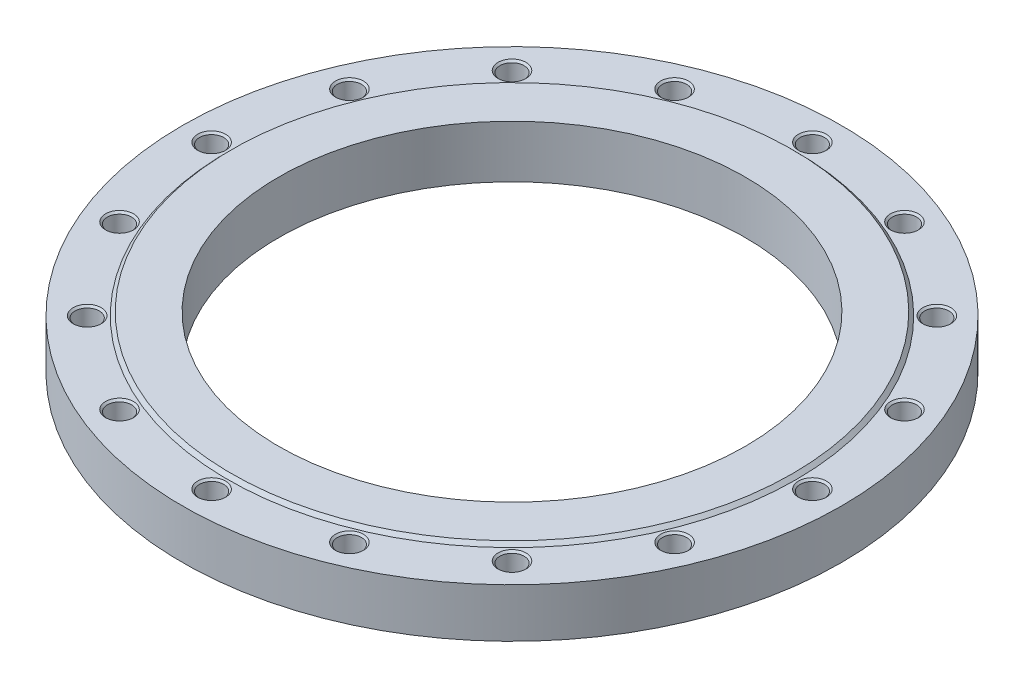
ISO-10303-21;
HEADER;
FILE_DESCRIPTION(('STEP AP214'),'2;1');
FILE_NAME('part.step','',(''),(''),'','','');
FILE_SCHEMA(('AUTOMOTIVE_DESIGN { 1 0 10303 214 1 1 1 1 }'));
ENDSEC;
DATA;
#1=APPLICATION_CONTEXT('core data for automotive mechanical design processes');
#2=APPLICATION_PROTOCOL_DEFINITION('international standard','automotive_design',2000,#1);
#3=PRODUCT_CONTEXT('',#1,'mechanical');
#4=PRODUCT('Part','Part','',(#3));
#5=PRODUCT_RELATED_PRODUCT_CATEGORY('part','',(#4));
#6=PRODUCT_DEFINITION_FORMATION('','',#4);
#7=PRODUCT_DEFINITION_CONTEXT('part definition',#1,'design');
#8=PRODUCT_DEFINITION('design','',#6,#7);
#9=PRODUCT_DEFINITION_SHAPE('','',#8);
#10=(LENGTH_UNIT() NAMED_UNIT(*) SI_UNIT(.MILLI.,.METRE.));
#11=(NAMED_UNIT(*) PLANE_ANGLE_UNIT() SI_UNIT($,.RADIAN.));
#12=(NAMED_UNIT(*) SI_UNIT($,.STERADIAN.) SOLID_ANGLE_UNIT());
#13=UNCERTAINTY_MEASURE_WITH_UNIT(LENGTH_MEASURE(1.E-05),#10,'distance_accuracy_value','');
#14=(GEOMETRIC_REPRESENTATION_CONTEXT(3) GLOBAL_UNCERTAINTY_ASSIGNED_CONTEXT((#13)) GLOBAL_UNIT_ASSIGNED_CONTEXT((#10,
#11,#12)) REPRESENTATION_CONTEXT('',''));
#15=CARTESIAN_POINT('',(0.,0.,0.));
#16=DIRECTION('',(0.,0.,1.));
#17=DIRECTION('',(1.,0.,0.));
#18=AXIS2_PLACEMENT_3D('',#15,#16,#17);
#19=CARTESIAN_POINT('',(0.,21.,0.));
#20=DIRECTION('',(0.,-1.,0.));
#21=DIRECTION('',(1.,0.,0.));
#22=AXIS2_PLACEMENT_3D('',#19,#20,#21);
#23=CYLINDRICAL_SURFACE('',#22,282.5);
#24=CARTESIAN_POINT('',(0.,0.,0.));
#25=DIRECTION('',(0.,1.,0.));
#26=DIRECTION('',(1.,0.,0.));
#27=AXIS2_PLACEMENT_3D('',#24,#25,#26);
#28=CIRCLE('',#27,282.5);
#29=CARTESIAN_POINT('',(282.5,0.,0.));
#30=VERTEX_POINT('',#29);
#31=EDGE_CURVE('E9',#30,#30,#28,.T.);
#32=ORIENTED_EDGE('',*,*,#31,.T.);
#33=EDGE_LOOP('',(#32));
#34=FACE_BOUND('',#33,.T.);
#35=CARTESIAN_POINT('',(0.,42.,0.));
#36=DIRECTION('',(0.,1.,0.));
#37=DIRECTION('',(1.,0.,0.));
#38=AXIS2_PLACEMENT_3D('',#35,#36,#37);
#39=CIRCLE('',#38,282.5);
#40=CARTESIAN_POINT('',(282.5,42.,0.));
#41=VERTEX_POINT('',#40);
#42=EDGE_CURVE('E18',#41,#41,#39,.T.);
#43=ORIENTED_EDGE('',*,*,#42,.F.);
#44=EDGE_LOOP('',(#43));
#45=FACE_BOUND('',#44,.T.);
#46=ADVANCED_FACE('F15',(#34,#45),#23,.T.);
#47=CARTESIAN_POINT('',(241.25,0.,0.));
#48=DIRECTION('',(0.,-1.,0.));
#49=DIRECTION('',(-1.,0.,0.));
#50=AXIS2_PLACEMENT_3D('',#47,#48,#49);
#51=PLANE('',#50);
#52=CARTESIAN_POINT('',(0.,0.,0.));
#53=DIRECTION('',(0.,1.,0.));
#54=DIRECTION('',(1.,0.,0.));
#55=AXIS2_PLACEMENT_3D('',#52,#53,#54);
#56=CIRCLE('',#55,200.);
#57=CARTESIAN_POINT('',(200.,0.,0.));
#58=VERTEX_POINT('',#57);
#59=EDGE_CURVE('E24',#58,#58,#56,.T.);
#60=ORIENTED_EDGE('',*,*,#59,.T.);
#61=EDGE_LOOP('',(#60));
#62=FACE_BOUND('',#61,.T.);
#63=ORIENTED_EDGE('',*,*,#31,.F.);
#64=EDGE_LOOP('',(#63));
#65=FACE_BOUND('',#64,.T.);
#66=ADVANCED_FACE('F475',(#62,#65),#51,.T.);
#67=CARTESIAN_POINT('',(0.,22.5,0.));
#68=DIRECTION('',(0.,-1.,0.));
#69=DIRECTION('',(1.,0.,0.));
#70=AXIS2_PLACEMENT_3D('',#67,#68,#69);
#71=CYLINDRICAL_SURFACE('',#70,200.);
#72=CARTESIAN_POINT('',(0.,45.,0.));
#73=DIRECTION('',(0.,1.,0.));
#74=DIRECTION('',(1.,0.,0.));
#75=AXIS2_PLACEMENT_3D('',#72,#73,#74);
#76=CIRCLE('',#75,200.);
#77=CARTESIAN_POINT('',(200.,45.,0.));
#78=VERTEX_POINT('',#77);
#79=EDGE_CURVE('E324',#78,#78,#76,.T.);
#80=ORIENTED_EDGE('',*,*,#79,.T.);
#81=EDGE_LOOP('',(#80));
#82=FACE_BOUND('',#81,.T.);
#83=ORIENTED_EDGE('',*,*,#59,.F.);
#84=EDGE_LOOP('',(#83));
#85=FACE_BOUND('',#84,.T.);
#86=ADVANCED_FACE('F479',(#82,#85),#71,.F.);
#87=CARTESIAN_POINT('',(220.25,45.,0.));
#88=DIRECTION('',(0.,1.,0.));
#89=DIRECTION('',(1.,0.,0.));
#90=AXIS2_PLACEMENT_3D('',#87,#88,#89);
#91=PLANE('',#90);
#92=CARTESIAN_POINT('',(0.,45.,0.));
#93=DIRECTION('',(0.,1.,0.));
#94=DIRECTION('',(1.,0.,0.));
#95=AXIS2_PLACEMENT_3D('',#92,#93,#94);
#96=CIRCLE('',#95,240.5);
#97=CARTESIAN_POINT('',(240.5,45.,0.));
#98=VERTEX_POINT('',#97);
#99=EDGE_CURVE('E322',#98,#98,#96,.T.);
#100=ORIENTED_EDGE('',*,*,#99,.T.);
#101=EDGE_LOOP('',(#100));
#102=FACE_BOUND('',#101,.T.);
#103=ORIENTED_EDGE('',*,*,#79,.F.);
#104=EDGE_LOOP('',(#103));
#105=FACE_BOUND('',#104,.T.);
#106=ADVANCED_FACE('F484',(#102,#105),#91,.T.);
#107=CARTESIAN_POINT('',(0.,43.5,0.));
#108=DIRECTION('',(0.,-1.,0.));
#109=DIRECTION('',(1.,0.,0.));
#110=AXIS2_PLACEMENT_3D('',#107,#108,#109);
#111=CONICAL_SURFACE('',#110,242.,0.785398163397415);
#112=CARTESIAN_POINT('',(0.,42.,0.));
#113=DIRECTION('',(0.,1.,0.));
#114=DIRECTION('',(1.,0.,0.));
#115=AXIS2_PLACEMENT_3D('',#112,#113,#114);
#116=CIRCLE('',#115,243.5);
#117=CARTESIAN_POINT('',(243.5,42.,0.));
#118=VERTEX_POINT('',#117);
#119=EDGE_CURVE('E323',#118,#118,#116,.T.);
#120=ORIENTED_EDGE('',*,*,#119,.T.);
#121=EDGE_LOOP('',(#120));
#122=FACE_BOUND('',#121,.T.);
#123=ORIENTED_EDGE('',*,*,#99,.F.);
#124=EDGE_LOOP('',(#123));
#125=FACE_BOUND('',#124,.T.);
#126=ADVANCED_FACE('F491',(#122,#125),#111,.T.);
#127=CARTESIAN_POINT('',(263.,42.,0.));
#128=DIRECTION('',(0.,1.,0.));
#129=DIRECTION('',(1.,0.,0.));
#130=AXIS2_PLACEMENT_3D('',#127,#128,#129);
#131=PLANE('',#130);
#132=ORIENTED_EDGE('',*,*,#42,.T.);
#133=EDGE_LOOP('',(#132));
#134=FACE_BOUND('',#133,.T.);
#135=ORIENTED_EDGE('',*,*,#119,.F.);
#136=EDGE_LOOP('',(#135));
#137=FACE_BOUND('',#136,.T.);
#138=CARTESIAN_POINT('',(257.5,42.,0.));
#139=DIRECTION('',(0.,-1.,0.));
#140=DIRECTION('',(1.,0.,0.));
#141=AXIS2_PLACEMENT_3D('',#138,#139,#140);
#142=CIRCLE('',#141,12.);
#143=CARTESIAN_POINT('',(269.5,42.,0.));
#144=VERTEX_POINT('',#143);
#145=EDGE_CURVE('E372',#144,#144,#142,.T.);
#146=ORIENTED_EDGE('',*,*,#145,.T.);
#147=EDGE_LOOP('',(#146));
#148=FACE_BOUND('',#147,.T.);
#149=CARTESIAN_POINT('',(237.898979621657,42.,-98.5409838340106));
#150=DIRECTION('',(0.,-1.,0.));
#151=DIRECTION('',(0.923879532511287,0.,-0.38268343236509));
#152=AXIS2_PLACEMENT_3D('',#149,#150,#151);
#153=CIRCLE('',#152,12.);
#154=CARTESIAN_POINT('',(248.985534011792,42.,-103.133185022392));
#155=VERTEX_POINT('',#154);
#156=EDGE_CURVE('E366',#155,#155,#153,.T.);
#157=ORIENTED_EDGE('',*,*,#156,.T.);
#158=EDGE_LOOP('',(#157));
#159=FACE_BOUND('',#158,.T.);
#160=CARTESIAN_POINT('',(182.079996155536,42.,-182.079996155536));
#161=DIRECTION('',(0.,-1.,0.));
#162=DIRECTION('',(0.707106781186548,0.,-0.707106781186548));
#163=AXIS2_PLACEMENT_3D('',#160,#161,#162);
#164=CIRCLE('',#163,12.);
#165=CARTESIAN_POINT('',(190.565277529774,42.,-190.565277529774));
#166=VERTEX_POINT('',#165);
#167=EDGE_CURVE('E362',#166,#166,#164,.T.);
#168=ORIENTED_EDGE('',*,*,#167,.T.);
#169=EDGE_LOOP('',(#168));
#170=FACE_BOUND('',#169,.T.);
#171=CARTESIAN_POINT('',(98.5409838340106,42.,-237.898979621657));
#172=DIRECTION('',(0.,-1.,0.));
#173=DIRECTION('',(0.38268343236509,0.,-0.923879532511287));
#174=AXIS2_PLACEMENT_3D('',#171,#172,#173);
#175=CIRCLE('',#174,12.);
#176=CARTESIAN_POINT('',(103.133185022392,42.,-248.985534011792));
#177=VERTEX_POINT('',#176);
#178=EDGE_CURVE('E354',#177,#177,#175,.T.);
#179=ORIENTED_EDGE('',*,*,#178,.T.);
#180=EDGE_LOOP('',(#179));
#181=FACE_BOUND('',#180,.T.);
#182=CARTESIAN_POINT('',(0.,42.,-257.5));
#183=DIRECTION('',(0.,-1.,0.));
#184=DIRECTION('',(0.,0.,-1.));
#185=AXIS2_PLACEMENT_3D('',#182,#183,#184);
#186=CIRCLE('',#185,12.);
#187=CARTESIAN_POINT('',(0.,42.,-269.5));
#188=VERTEX_POINT('',#187);
#189=EDGE_CURVE('E1524',#188,#188,#186,.T.);
#190=ORIENTED_EDGE('',*,*,#189,.T.);
#191=EDGE_LOOP('',(#190));
#192=FACE_BOUND('',#191,.T.);
#193=CARTESIAN_POINT('',(-98.5409838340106,42.,-237.898979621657));
#194=DIRECTION('',(0.,-1.,0.));
#195=DIRECTION('',(-0.38268343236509,0.,-0.923879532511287));
#196=AXIS2_PLACEMENT_3D('',#193,#194,#195);
#197=CIRCLE('',#196,12.);
#198=CARTESIAN_POINT('',(-103.133185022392,42.,-248.985534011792));
#199=VERTEX_POINT('',#198);
#200=EDGE_CURVE('E339',#199,#199,#197,.T.);
#201=ORIENTED_EDGE('',*,*,#200,.T.);
#202=EDGE_LOOP('',(#201));
#203=FACE_BOUND('',#202,.T.);
#204=CARTESIAN_POINT('',(-182.079996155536,42.,-182.079996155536));
#205=DIRECTION('',(0.,-1.,0.));
#206=DIRECTION('',(-0.707106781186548,0.,-0.707106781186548));
#207=AXIS2_PLACEMENT_3D('',#204,#205,#206);
#208=CIRCLE('',#207,12.);
#209=CARTESIAN_POINT('',(-190.565277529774,42.,-190.565277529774));
#210=VERTEX_POINT('',#209);
#211=EDGE_CURVE('E442',#210,#210,#208,.T.);
#212=ORIENTED_EDGE('',*,*,#211,.T.);
#213=EDGE_LOOP('',(#212));
#214=FACE_BOUND('',#213,.T.);
#215=CARTESIAN_POINT('',(-237.898979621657,42.,-98.5409838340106));
#216=DIRECTION('',(0.,-1.,0.));
#217=DIRECTION('',(-0.923879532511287,0.,-0.38268343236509));
#218=AXIS2_PLACEMENT_3D('',#215,#216,#217);
#219=CIRCLE('',#218,12.);
#220=CARTESIAN_POINT('',(-248.985534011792,42.,-103.133185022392));
#221=VERTEX_POINT('',#220);
#222=EDGE_CURVE('E423',#221,#221,#219,.T.);
#223=ORIENTED_EDGE('',*,*,#222,.T.);
#224=EDGE_LOOP('',(#223));
#225=FACE_BOUND('',#224,.T.);
#226=CARTESIAN_POINT('',(-257.5,42.,0.));
#227=DIRECTION('',(0.,-1.,0.));
#228=DIRECTION('',(-1.,0.,0.));
#229=AXIS2_PLACEMENT_3D('',#226,#227,#228);
#230=CIRCLE('',#229,12.);
#231=CARTESIAN_POINT('',(-269.5,42.,0.));
#232=VERTEX_POINT('',#231);
#233=EDGE_CURVE('E405',#232,#232,#230,.T.);
#234=ORIENTED_EDGE('',*,*,#233,.T.);
#235=EDGE_LOOP('',(#234));
#236=FACE_BOUND('',#235,.T.);
#237=CARTESIAN_POINT('',(-237.898979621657,42.,98.5409838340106));
#238=DIRECTION('',(0.,-1.,0.));
#239=DIRECTION('',(-0.923879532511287,0.,0.38268343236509));
#240=AXIS2_PLACEMENT_3D('',#237,#238,#239);
#241=CIRCLE('',#240,12.);
#242=CARTESIAN_POINT('',(-248.985534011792,42.,103.133185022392));
#243=VERTEX_POINT('',#242);
#244=EDGE_CURVE('E392',#243,#243,#241,.T.);
#245=ORIENTED_EDGE('',*,*,#244,.T.);
#246=EDGE_LOOP('',(#245));
#247=FACE_BOUND('',#246,.T.);
#248=CARTESIAN_POINT('',(-182.079996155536,42.,182.079996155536));
#249=DIRECTION('',(0.,-1.,0.));
#250=DIRECTION('',(-0.707106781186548,0.,0.707106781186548));
#251=AXIS2_PLACEMENT_3D('',#248,#249,#250);
#252=CIRCLE('',#251,12.);
#253=CARTESIAN_POINT('',(-190.565277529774,42.,190.565277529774));
#254=VERTEX_POINT('',#253);
#255=EDGE_CURVE('E1536',#254,#254,#252,.T.);
#256=ORIENTED_EDGE('',*,*,#255,.T.);
#257=EDGE_LOOP('',(#256));
#258=FACE_BOUND('',#257,.T.);
#259=CARTESIAN_POINT('',(-98.5409838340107,42.,237.898979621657));
#260=DIRECTION('',(0.,-1.,0.));
#261=DIRECTION('',(-0.382683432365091,0.,0.923879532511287));
#262=AXIS2_PLACEMENT_3D('',#259,#260,#261);
#263=CIRCLE('',#262,12.);
#264=CARTESIAN_POINT('',(-103.133185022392,42.,248.985534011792));
#265=VERTEX_POINT('',#264);
#266=EDGE_CURVE('E1544',#265,#265,#263,.T.);
#267=ORIENTED_EDGE('',*,*,#266,.T.);
#268=EDGE_LOOP('',(#267));
#269=FACE_BOUND('',#268,.T.);
#270=CARTESIAN_POINT('',(0.,42.,257.5));
#271=DIRECTION('',(0.,-1.,0.));
#272=DIRECTION('',(0.,0.,1.));
#273=AXIS2_PLACEMENT_3D('',#270,#271,#272);
#274=CIRCLE('',#273,12.);
#275=CARTESIAN_POINT('',(0.,42.,269.5));
#276=VERTEX_POINT('',#275);
#277=EDGE_CURVE('E1565',#276,#276,#274,.T.);
#278=ORIENTED_EDGE('',*,*,#277,.T.);
#279=EDGE_LOOP('',(#278));
#280=FACE_BOUND('',#279,.T.);
#281=CARTESIAN_POINT('',(98.5409838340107,42.,237.898979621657));
#282=DIRECTION('',(0.,-1.,0.));
#283=DIRECTION('',(0.38268343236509,0.,0.923879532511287));
#284=AXIS2_PLACEMENT_3D('',#281,#282,#283);
#285=CIRCLE('',#284,12.);
#286=CARTESIAN_POINT('',(103.133185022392,42.,248.985534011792));
#287=VERTEX_POINT('',#286);
#288=EDGE_CURVE('E1508',#287,#287,#285,.T.);
#289=ORIENTED_EDGE('',*,*,#288,.T.);
#290=EDGE_LOOP('',(#289));
#291=FACE_BOUND('',#290,.T.);
#292=CARTESIAN_POINT('',(182.079996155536,42.,182.079996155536));
#293=DIRECTION('',(0.,-1.,0.));
#294=DIRECTION('',(0.707106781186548,0.,0.707106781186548));
#295=AXIS2_PLACEMENT_3D('',#292,#293,#294);
#296=CIRCLE('',#295,12.);
#297=CARTESIAN_POINT('',(190.565277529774,42.,190.565277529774));
#298=VERTEX_POINT('',#297);
#299=EDGE_CURVE('E1520',#298,#298,#296,.T.);
#300=ORIENTED_EDGE('',*,*,#299,.T.);
#301=EDGE_LOOP('',(#300));
#302=FACE_BOUND('',#301,.T.);
#303=CARTESIAN_POINT('',(237.898979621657,42.,98.5409838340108));
#304=DIRECTION('',(0.,-1.,0.));
#305=DIRECTION('',(0.923879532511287,0.,0.382683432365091));
#306=AXIS2_PLACEMENT_3D('',#303,#304,#305);
#307=CIRCLE('',#306,12.);
#308=CARTESIAN_POINT('',(248.985534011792,42.,103.133185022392));
#309=VERTEX_POINT('',#308);
#310=EDGE_CURVE('E1496',#309,#309,#307,.T.);
#311=ORIENTED_EDGE('',*,*,#310,.T.);
#312=EDGE_LOOP('',(#311));
#313=FACE_BOUND('',#312,.T.);
#314=ADVANCED_FACE('F319',(#134,#137,#148,#159,#170,#181,#192,#203,#214,#225,#236,#247,#258,
#269,#280,#291,#302,#313),#131,.T.);
#315=CARTESIAN_POINT('',(257.5,6.00463463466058,0.));
#316=DIRECTION('',(0.,1.,0.));
#317=DIRECTION('',(1.,0.,0.));
#318=AXIS2_PLACEMENT_3D('',#315,#316,#317);
#319=CONICAL_SURFACE('',#318,5.188125,1.0471975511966);
#320=CARTESIAN_POINT('',(257.5,9.,0.));
#321=DIRECTION('',(0.,-1.,0.));
#322=DIRECTION('',(1.,0.,0.));
#323=AXIS2_PLACEMENT_3D('',#320,#321,#322);
#324=CIRCLE('',#323,10.37625);
#325=CARTESIAN_POINT('',(267.87625,9.,0.));
#326=VERTEX_POINT('',#325);
#327=EDGE_CURVE('E326',#326,#326,#324,.T.);
#328=ORIENTED_EDGE('',*,*,#327,.F.);
#329=EDGE_LOOP('',(#328));
#330=FACE_BOUND('',#329,.T.);
#331=CARTESIAN_POINT('',(257.5,3.00926926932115,0.));
#332=VERTEX_POINT('',#331);
#333=VERTEX_LOOP('',#332);
#334=FACE_BOUND('',#333,.T.);
#335=ADVANCED_FACE('F495',(#330,#334),#319,.F.);
#336=CARTESIAN_POINT('',(257.5,12.688125,0.));
#337=DIRECTION('',(0.,1.,0.));
#338=DIRECTION('',(1.,0.,0.));
#339=AXIS2_PLACEMENT_3D('',#336,#337,#338);
#340=CYLINDRICAL_SURFACE('',#339,10.37625);
#341=CARTESIAN_POINT('',(257.5,16.37625,0.));
#342=DIRECTION('',(0.,-1.,0.));
#343=DIRECTION('',(1.,0.,0.));
#344=AXIS2_PLACEMENT_3D('',#341,#342,#343);
#345=CIRCLE('',#344,10.37625);
#346=CARTESIAN_POINT('',(267.87625,16.37625,0.));
#347=VERTEX_POINT('',#346);
#348=EDGE_CURVE('E330',#347,#347,#345,.T.);
#349=ORIENTED_EDGE('',*,*,#348,.F.);
#350=EDGE_LOOP('',(#349));
#351=FACE_BOUND('',#350,.T.);
#352=ORIENTED_EDGE('',*,*,#327,.T.);
#353=EDGE_LOOP('',(#352));
#354=FACE_BOUND('',#353,.T.);
#355=ADVANCED_FACE('F739',(#351,#354),#340,.F.);
#356=CARTESIAN_POINT('',(257.5,17.188125,0.));
#357=DIRECTION('',(0.,1.,0.));
#358=DIRECTION('',(1.,0.,0.));
#359=AXIS2_PLACEMENT_3D('',#356,#357,#358);
#360=CONICAL_SURFACE('',#359,11.188125,0.785398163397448);
#361=CARTESIAN_POINT('',(257.5,18.,0.));
#362=DIRECTION('',(0.,-1.,0.));
#363=DIRECTION('',(1.,0.,0.));
#364=AXIS2_PLACEMENT_3D('',#361,#362,#363);
#365=CIRCLE('',#364,12.);
#366=CARTESIAN_POINT('',(269.5,18.,0.));
#367=VERTEX_POINT('',#366);
#368=EDGE_CURVE('E374',#367,#367,#365,.T.);
#369=ORIENTED_EDGE('',*,*,#368,.F.);
#370=EDGE_LOOP('',(#369));
#371=FACE_BOUND('',#370,.T.);
#372=ORIENTED_EDGE('',*,*,#348,.T.);
#373=EDGE_LOOP('',(#372));
#374=FACE_BOUND('',#373,.T.);
#375=ADVANCED_FACE('F607',(#371,#374),#360,.F.);
#376=CARTESIAN_POINT('',(268.688125,18.,0.));
#377=DIRECTION('',(0.,1.,0.));
#378=DIRECTION('',(-1.,0.,0.));
#379=AXIS2_PLACEMENT_3D('',#376,#377,#378);
#380=PLANE('',#379);
#381=CARTESIAN_POINT('',(257.5,18.,0.));
#382=DIRECTION('',(0.,-1.,0.));
#383=DIRECTION('',(1.,0.,0.));
#384=AXIS2_PLACEMENT_3D('',#381,#382,#383);
#385=CIRCLE('',#384,10.37625);
#386=CARTESIAN_POINT('',(267.87625,18.,0.));
#387=VERTEX_POINT('',#386);
#388=EDGE_CURVE('E373',#387,#387,#385,.T.);
#389=ORIENTED_EDGE('',*,*,#388,.F.);
#390=EDGE_LOOP('',(#389));
#391=FACE_BOUND('',#390,.T.);
#392=ORIENTED_EDGE('',*,*,#368,.T.);
#393=EDGE_LOOP('',(#392));
#394=FACE_BOUND('',#393,.T.);
#395=ADVANCED_FACE('F604',(#391,#394),#380,.F.);
#396=CARTESIAN_POINT('',(257.5,29.188125,0.));
#397=DIRECTION('',(0.,1.,0.));
#398=DIRECTION('',(1.,0.,0.));
#399=AXIS2_PLACEMENT_3D('',#396,#397,#398);
#400=CYLINDRICAL_SURFACE('',#399,10.37625);
#401=CARTESIAN_POINT('',(257.5,40.37625,0.));
#402=DIRECTION('',(0.,-1.,0.));
#403=DIRECTION('',(1.,0.,0.));
#404=AXIS2_PLACEMENT_3D('',#401,#402,#403);
#405=CIRCLE('',#404,10.37625);
#406=CARTESIAN_POINT('',(267.87625,40.37625,0.));
#407=VERTEX_POINT('',#406);
#408=EDGE_CURVE('E371',#407,#407,#405,.T.);
#409=ORIENTED_EDGE('',*,*,#408,.F.);
#410=EDGE_LOOP('',(#409));
#411=FACE_BOUND('',#410,.T.);
#412=ORIENTED_EDGE('',*,*,#388,.T.);
#413=EDGE_LOOP('',(#412));
#414=FACE_BOUND('',#413,.T.);
#415=ADVANCED_FACE('F500',(#411,#414),#400,.F.);
#416=CARTESIAN_POINT('',(257.5,41.188125,0.));
#417=DIRECTION('',(0.,1.,0.));
#418=DIRECTION('',(1.,0.,0.));
#419=AXIS2_PLACEMENT_3D('',#416,#417,#418);
#420=CONICAL_SURFACE('',#419,11.188125,0.785398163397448);
#421=ORIENTED_EDGE('',*,*,#145,.F.);
#422=EDGE_LOOP('',(#421));
#423=FACE_BOUND('',#422,.T.);
#424=ORIENTED_EDGE('',*,*,#408,.T.);
#425=EDGE_LOOP('',(#424));
#426=FACE_BOUND('',#425,.T.);
#427=ADVANCED_FACE('F496',(#423,#426),#420,.F.);
#428=CARTESIAN_POINT('',(237.898979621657,6.00463463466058,-98.5409838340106));
#429=DIRECTION('',(0.,1.,0.));
#430=DIRECTION('',(0.923879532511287,0.,-0.38268343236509));
#431=AXIS2_PLACEMENT_3D('',#428,#429,#430);
#432=CONICAL_SURFACE('',#431,5.188125,1.0471975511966);
#433=CARTESIAN_POINT('',(237.898979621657,9.,-98.5409838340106));
#434=DIRECTION('',(0.,-1.,0.));
#435=DIRECTION('',(0.923879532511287,0.,-0.38268343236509));
#436=AXIS2_PLACEMENT_3D('',#433,#434,#435);
#437=CIRCLE('',#436,10.37625);
#438=CARTESIAN_POINT('',(247.485384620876,9.,-102.511802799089));
#439=VERTEX_POINT('',#438);
#440=EDGE_CURVE('E369',#439,#439,#437,.T.);
#441=ORIENTED_EDGE('',*,*,#440,.F.);
#442=EDGE_LOOP('',(#441));
#443=FACE_BOUND('',#442,.T.);
#444=CARTESIAN_POINT('',(237.898979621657,3.00926926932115,-98.5409838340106));
#445=VERTEX_POINT('',#444);
#446=VERTEX_LOOP('',#445);
#447=FACE_BOUND('',#446,.T.);
#448=ADVANCED_FACE('F499',(#443,#447),#432,.F.);
#449=CARTESIAN_POINT('',(237.898979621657,12.688125,-98.5409838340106));
#450=DIRECTION('',(0.,1.,0.));
#451=DIRECTION('',(0.923879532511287,0.,-0.38268343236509));
#452=AXIS2_PLACEMENT_3D('',#449,#450,#451);
#453=CYLINDRICAL_SURFACE('',#452,10.37625);
#454=CARTESIAN_POINT('',(237.898979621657,16.37625,-98.5409838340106));
#455=DIRECTION('',(0.,-1.,0.));
#456=DIRECTION('',(0.923879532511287,0.,-0.38268343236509));
#457=AXIS2_PLACEMENT_3D('',#454,#455,#456);
#458=CIRCLE('',#457,10.37625);
#459=CARTESIAN_POINT('',(247.485384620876,16.37625,-102.511802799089));
#460=VERTEX_POINT('',#459);
#461=EDGE_CURVE('E368',#460,#460,#458,.T.);
#462=ORIENTED_EDGE('',*,*,#461,.F.);
#463=EDGE_LOOP('',(#462));
#464=FACE_BOUND('',#463,.T.);
#465=ORIENTED_EDGE('',*,*,#440,.T.);
#466=EDGE_LOOP('',(#465));
#467=FACE_BOUND('',#466,.T.);
#468=ADVANCED_FACE('F656',(#464,#467),#453,.F.);
#469=CARTESIAN_POINT('',(237.898979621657,17.188125,-98.5409838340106));
#470=DIRECTION('',(0.,1.,0.));
#471=DIRECTION('',(0.923879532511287,0.,-0.38268343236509));
#472=AXIS2_PLACEMENT_3D('',#469,#470,#471);
#473=CONICAL_SURFACE('',#472,11.188125,0.785398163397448);
#474=CARTESIAN_POINT('',(237.898979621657,18.,-98.5409838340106));
#475=DIRECTION('',(0.,-1.,0.));
#476=DIRECTION('',(0.923879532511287,0.,-0.38268343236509));
#477=AXIS2_PLACEMENT_3D('',#474,#475,#476);
#478=CIRCLE('',#477,12.);
#479=CARTESIAN_POINT('',(248.985534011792,18.,-103.133185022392));
#480=VERTEX_POINT('',#479);
#481=EDGE_CURVE('E365',#480,#480,#478,.T.);
#482=ORIENTED_EDGE('',*,*,#481,.F.);
#483=EDGE_LOOP('',(#482));
#484=FACE_BOUND('',#483,.T.);
#485=ORIENTED_EDGE('',*,*,#461,.T.);
#486=EDGE_LOOP('',(#485));
#487=FACE_BOUND('',#486,.T.);
#488=ADVANCED_FACE('F725',(#484,#487),#473,.F.);
#489=CARTESIAN_POINT('',(248.235459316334,18.,-102.82249391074));
#490=DIRECTION('',(0.,1.,0.));
#491=DIRECTION('',(-0.923879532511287,0.,0.38268343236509));
#492=AXIS2_PLACEMENT_3D('',#489,#490,#491);
#493=PLANE('',#492);
#494=CARTESIAN_POINT('',(237.898979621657,18.,-98.5409838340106));
#495=DIRECTION('',(0.,-1.,0.));
#496=DIRECTION('',(0.923879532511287,0.,-0.38268343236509));
#497=AXIS2_PLACEMENT_3D('',#494,#495,#496);
#498=CIRCLE('',#497,10.37625);
#499=CARTESIAN_POINT('',(247.485384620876,18.,-102.511802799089));
#500=VERTEX_POINT('',#499);
#501=EDGE_CURVE('E363',#500,#500,#498,.T.);
#502=ORIENTED_EDGE('',*,*,#501,.F.);
#503=EDGE_LOOP('',(#502));
#504=FACE_BOUND('',#503,.T.);
#505=ORIENTED_EDGE('',*,*,#481,.T.);
#506=EDGE_LOOP('',(#505));
#507=FACE_BOUND('',#506,.T.);
#508=ADVANCED_FACE('F728',(#504,#507),#493,.F.);
#509=CARTESIAN_POINT('',(237.898979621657,29.188125,-98.5409838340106));
#510=DIRECTION('',(0.,1.,0.));
#511=DIRECTION('',(0.923879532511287,0.,-0.38268343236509));
#512=AXIS2_PLACEMENT_3D('',#509,#510,#511);
#513=CYLINDRICAL_SURFACE('',#512,10.37625);
#514=CARTESIAN_POINT('',(237.898979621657,40.37625,-98.5409838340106));
#515=DIRECTION('',(0.,-1.,0.));
#516=DIRECTION('',(0.923879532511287,0.,-0.38268343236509));
#517=AXIS2_PLACEMENT_3D('',#514,#515,#516);
#518=CIRCLE('',#517,10.37625);
#519=CARTESIAN_POINT('',(247.485384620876,40.37625,-102.511802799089));
#520=VERTEX_POINT('',#519);
#521=EDGE_CURVE('E450',#520,#520,#518,.T.);
#522=ORIENTED_EDGE('',*,*,#521,.F.);
#523=EDGE_LOOP('',(#522));
#524=FACE_BOUND('',#523,.T.);
#525=ORIENTED_EDGE('',*,*,#501,.T.);
#526=EDGE_LOOP('',(#525));
#527=FACE_BOUND('',#526,.T.);
#528=ADVANCED_FACE('F746',(#524,#527),#513,.F.);
#529=CARTESIAN_POINT('',(237.898979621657,41.188125,-98.5409838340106));
#530=DIRECTION('',(0.,1.,0.));
#531=DIRECTION('',(0.923879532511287,0.,-0.38268343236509));
#532=AXIS2_PLACEMENT_3D('',#529,#530,#531);
#533=CONICAL_SURFACE('',#532,11.188125,0.785398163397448);
#534=ORIENTED_EDGE('',*,*,#156,.F.);
#535=EDGE_LOOP('',(#534));
#536=FACE_BOUND('',#535,.T.);
#537=ORIENTED_EDGE('',*,*,#521,.T.);
#538=EDGE_LOOP('',(#537));
#539=FACE_BOUND('',#538,.T.);
#540=ADVANCED_FACE('F506',(#536,#539),#533,.F.);
#541=CARTESIAN_POINT('',(182.079996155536,6.00463463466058,-182.079996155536));
#542=DIRECTION('',(0.,1.,0.));
#543=DIRECTION('',(0.707106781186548,0.,-0.707106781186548));
#544=AXIS2_PLACEMENT_3D('',#541,#542,#543);
#545=CONICAL_SURFACE('',#544,5.188125,1.0471975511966);
#546=CARTESIAN_POINT('',(182.079996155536,9.,-182.079996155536));
#547=DIRECTION('',(0.,-1.,0.));
#548=DIRECTION('',(0.707106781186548,0.,-0.707106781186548));
#549=AXIS2_PLACEMENT_3D('',#546,#547,#548);
#550=CIRCLE('',#549,10.37625);
#551=CARTESIAN_POINT('',(189.417112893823,9.,-189.417112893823));
#552=VERTEX_POINT('',#551);
#553=EDGE_CURVE('E427',#552,#552,#550,.T.);
#554=ORIENTED_EDGE('',*,*,#553,.F.);
#555=EDGE_LOOP('',(#554));
#556=FACE_BOUND('',#555,.T.);
#557=CARTESIAN_POINT('',(182.079996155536,3.00926926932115,-182.079996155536));
#558=VERTEX_POINT('',#557);
#559=VERTEX_LOOP('',#558);
#560=FACE_BOUND('',#559,.T.);
#561=ADVANCED_FACE('F502',(#556,#560),#545,.F.);
#562=CARTESIAN_POINT('',(182.079996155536,12.688125,-182.079996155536));
#563=DIRECTION('',(0.,1.,0.));
#564=DIRECTION('',(0.707106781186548,0.,-0.707106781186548));
#565=AXIS2_PLACEMENT_3D('',#562,#563,#564);
#566=CYLINDRICAL_SURFACE('',#565,10.37625);
#567=CARTESIAN_POINT('',(182.079996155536,16.37625,-182.079996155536));
#568=DIRECTION('',(0.,-1.,0.));
#569=DIRECTION('',(0.707106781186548,0.,-0.707106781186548));
#570=AXIS2_PLACEMENT_3D('',#567,#568,#569);
#571=CIRCLE('',#570,10.37625);
#572=CARTESIAN_POINT('',(189.417112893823,16.37625,-189.417112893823));
#573=VERTEX_POINT('',#572);
#574=EDGE_CURVE('E408',#573,#573,#571,.T.);
#575=ORIENTED_EDGE('',*,*,#574,.F.);
#576=EDGE_LOOP('',(#575));
#577=FACE_BOUND('',#576,.T.);
#578=ORIENTED_EDGE('',*,*,#553,.T.);
#579=EDGE_LOOP('',(#578));
#580=FACE_BOUND('',#579,.T.);
#581=ADVANCED_FACE('F505',(#577,#580),#566,.F.);
#582=CARTESIAN_POINT('',(182.079996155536,17.188125,-182.079996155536));
#583=DIRECTION('',(0.,1.,0.));
#584=DIRECTION('',(0.707106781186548,0.,-0.707106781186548));
#585=AXIS2_PLACEMENT_3D('',#582,#583,#584);
#586=CONICAL_SURFACE('',#585,11.188125,0.785398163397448);
#587=CARTESIAN_POINT('',(182.079996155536,18.,-182.079996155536));
#588=DIRECTION('',(0.,-1.,0.));
#589=DIRECTION('',(0.707106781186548,0.,-0.707106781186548));
#590=AXIS2_PLACEMENT_3D('',#587,#588,#589);
#591=CIRCLE('',#590,12.);
#592=CARTESIAN_POINT('',(190.565277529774,18.,-190.565277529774));
#593=VERTEX_POINT('',#592);
#594=EDGE_CURVE('E406',#593,#593,#591,.T.);
#595=ORIENTED_EDGE('',*,*,#594,.F.);
#596=EDGE_LOOP('',(#595));
#597=FACE_BOUND('',#596,.T.);
#598=ORIENTED_EDGE('',*,*,#574,.T.);
#599=EDGE_LOOP('',(#598));
#600=FACE_BOUND('',#599,.T.);
#601=ADVANCED_FACE('F508',(#597,#600),#586,.F.);
#602=CARTESIAN_POINT('',(189.991195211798,18.,-189.991195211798));
#603=DIRECTION('',(0.,1.,0.));
#604=DIRECTION('',(-0.707106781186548,0.,0.707106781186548));
#605=AXIS2_PLACEMENT_3D('',#602,#603,#604);
#606=PLANE('',#605);
#607=CARTESIAN_POINT('',(182.079996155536,18.,-182.079996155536));
#608=DIRECTION('',(0.,-1.,0.));
#609=DIRECTION('',(0.707106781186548,0.,-0.707106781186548));
#610=AXIS2_PLACEMENT_3D('',#607,#608,#609);
#611=CIRCLE('',#610,10.37625);
#612=CARTESIAN_POINT('',(189.417112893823,18.,-189.417112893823));
#613=VERTEX_POINT('',#612);
#614=EDGE_CURVE('E409',#613,#613,#611,.T.);
#615=ORIENTED_EDGE('',*,*,#614,.F.);
#616=EDGE_LOOP('',(#615));
#617=FACE_BOUND('',#616,.T.);
#618=ORIENTED_EDGE('',*,*,#594,.T.);
#619=EDGE_LOOP('',(#618));
#620=FACE_BOUND('',#619,.T.);
#621=ADVANCED_FACE('F511',(#617,#620),#606,.F.);
#622=CARTESIAN_POINT('',(182.079996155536,29.188125,-182.079996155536));
#623=DIRECTION('',(0.,1.,0.));
#624=DIRECTION('',(0.707106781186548,0.,-0.707106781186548));
#625=AXIS2_PLACEMENT_3D('',#622,#623,#624);
#626=CYLINDRICAL_SURFACE('',#625,10.37625);
#627=CARTESIAN_POINT('',(182.079996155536,40.37625,-182.079996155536));
#628=DIRECTION('',(0.,-1.,0.));
#629=DIRECTION('',(0.707106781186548,0.,-0.707106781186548));
#630=AXIS2_PLACEMENT_3D('',#627,#628,#629);
#631=CIRCLE('',#630,10.37625);
#632=CARTESIAN_POINT('',(189.417112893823,40.37625,-189.417112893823));
#633=VERTEX_POINT('',#632);
#634=EDGE_CURVE('E360',#633,#633,#631,.T.);
#635=ORIENTED_EDGE('',*,*,#634,.F.);
#636=EDGE_LOOP('',(#635));
#637=FACE_BOUND('',#636,.T.);
#638=ORIENTED_EDGE('',*,*,#614,.T.);
#639=EDGE_LOOP('',(#638));
#640=FACE_BOUND('',#639,.T.);
#641=ADVANCED_FACE('F517',(#637,#640),#626,.F.);
#642=CARTESIAN_POINT('',(182.079996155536,41.188125,-182.079996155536));
#643=DIRECTION('',(0.,1.,0.));
#644=DIRECTION('',(0.707106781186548,0.,-0.707106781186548));
#645=AXIS2_PLACEMENT_3D('',#642,#643,#644);
#646=CONICAL_SURFACE('',#645,11.188125,0.785398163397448);
#647=ORIENTED_EDGE('',*,*,#167,.F.);
#648=EDGE_LOOP('',(#647));
#649=FACE_BOUND('',#648,.T.);
#650=ORIENTED_EDGE('',*,*,#634,.T.);
#651=EDGE_LOOP('',(#650));
#652=FACE_BOUND('',#651,.T.);
#653=ADVANCED_FACE('F513',(#649,#652),#646,.F.);
#654=CARTESIAN_POINT('',(98.5409838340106,6.00463463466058,-237.898979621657));
#655=DIRECTION('',(0.,1.,0.));
#656=DIRECTION('',(0.38268343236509,0.,-0.923879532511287));
#657=AXIS2_PLACEMENT_3D('',#654,#655,#656);
#658=CONICAL_SURFACE('',#657,5.188125,1.0471975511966);
#659=CARTESIAN_POINT('',(98.5409838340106,9.,-237.898979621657));
#660=DIRECTION('',(0.,-1.,0.));
#661=DIRECTION('',(0.38268343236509,0.,-0.923879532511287));
#662=AXIS2_PLACEMENT_3D('',#659,#660,#661);
#663=CIRCLE('',#662,10.37625);
#664=CARTESIAN_POINT('',(102.511802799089,9.,-247.485384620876));
#665=VERTEX_POINT('',#664);
#666=EDGE_CURVE('E357',#665,#665,#663,.T.);
#667=ORIENTED_EDGE('',*,*,#666,.F.);
#668=EDGE_LOOP('',(#667));
#669=FACE_BOUND('',#668,.T.);
#670=CARTESIAN_POINT('',(98.5409838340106,3.00926926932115,-237.898979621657));
#671=VERTEX_POINT('',#670);
#672=VERTEX_LOOP('',#671);
#673=FACE_BOUND('',#672,.T.);
#674=ADVANCED_FACE('F516',(#669,#673),#658,.F.);
#675=CARTESIAN_POINT('',(98.5409838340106,12.688125,-237.898979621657));
#676=DIRECTION('',(0.,1.,0.));
#677=DIRECTION('',(0.38268343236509,0.,-0.923879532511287));
#678=AXIS2_PLACEMENT_3D('',#675,#676,#677);
#679=CYLINDRICAL_SURFACE('',#678,10.37625);
#680=CARTESIAN_POINT('',(98.5409838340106,16.37625,-237.898979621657));
#681=DIRECTION('',(0.,-1.,0.));
#682=DIRECTION('',(0.38268343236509,0.,-0.923879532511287));
#683=AXIS2_PLACEMENT_3D('',#680,#681,#682);
#684=CIRCLE('',#683,10.37625);
#685=CARTESIAN_POINT('',(102.511802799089,16.37625,-247.485384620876));
#686=VERTEX_POINT('',#685);
#687=EDGE_CURVE('E355',#686,#686,#684,.T.);
#688=ORIENTED_EDGE('',*,*,#687,.F.);
#689=EDGE_LOOP('',(#688));
#690=FACE_BOUND('',#689,.T.);
#691=ORIENTED_EDGE('',*,*,#666,.T.);
#692=EDGE_LOOP('',(#691));
#693=FACE_BOUND('',#692,.T.);
#694=ADVANCED_FACE('F523',(#690,#693),#679,.F.);
#695=CARTESIAN_POINT('',(98.5409838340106,17.188125,-237.898979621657));
#696=DIRECTION('',(0.,1.,0.));
#697=DIRECTION('',(0.38268343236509,0.,-0.923879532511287));
#698=AXIS2_PLACEMENT_3D('',#695,#696,#697);
#699=CONICAL_SURFACE('',#698,11.188125,0.785398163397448);
#700=CARTESIAN_POINT('',(98.5409838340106,18.,-237.898979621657));
#701=DIRECTION('',(0.,-1.,0.));
#702=DIRECTION('',(0.38268343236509,0.,-0.923879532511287));
#703=AXIS2_PLACEMENT_3D('',#700,#701,#702);
#704=CIRCLE('',#703,12.);
#705=CARTESIAN_POINT('',(103.133185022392,18.,-248.985534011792));
#706=VERTEX_POINT('',#705);
#707=EDGE_CURVE('E358',#706,#706,#704,.T.);
#708=ORIENTED_EDGE('',*,*,#707,.F.);
#709=EDGE_LOOP('',(#708));
#710=FACE_BOUND('',#709,.T.);
#711=ORIENTED_EDGE('',*,*,#687,.T.);
#712=EDGE_LOOP('',(#711));
#713=FACE_BOUND('',#712,.T.);
#714=ADVANCED_FACE('F519',(#710,#713),#699,.F.);
#715=CARTESIAN_POINT('',(102.82249391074,18.,-248.235459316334));
#716=DIRECTION('',(0.,1.,0.));
#717=DIRECTION('',(-0.38268343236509,0.,0.923879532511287));
#718=AXIS2_PLACEMENT_3D('',#715,#716,#717);
#719=PLANE('',#718);
#720=CARTESIAN_POINT('',(98.5409838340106,18.,-237.898979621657));
#721=DIRECTION('',(0.,-1.,0.));
#722=DIRECTION('',(0.38268343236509,0.,-0.923879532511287));
#723=AXIS2_PLACEMENT_3D('',#720,#721,#722);
#724=CIRCLE('',#723,10.37625);
#725=CARTESIAN_POINT('',(102.511802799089,18.,-247.485384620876));
#726=VERTEX_POINT('',#725);
#727=EDGE_CURVE('E395',#726,#726,#724,.T.);
#728=ORIENTED_EDGE('',*,*,#727,.F.);
#729=EDGE_LOOP('',(#728));
#730=FACE_BOUND('',#729,.T.);
#731=ORIENTED_EDGE('',*,*,#707,.T.);
#732=EDGE_LOOP('',(#731));
#733=FACE_BOUND('',#732,.T.);
#734=ADVANCED_FACE('F522',(#730,#733),#719,.F.);
#735=CARTESIAN_POINT('',(98.5409838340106,29.188125,-237.898979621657));
#736=DIRECTION('',(0.,1.,0.));
#737=DIRECTION('',(0.38268343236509,0.,-0.923879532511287));
#738=AXIS2_PLACEMENT_3D('',#735,#736,#737);
#739=CYLINDRICAL_SURFACE('',#738,10.37625);
#740=CARTESIAN_POINT('',(98.5409838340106,40.37625,-237.898979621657));
#741=DIRECTION('',(0.,-1.,0.));
#742=DIRECTION('',(0.38268343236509,0.,-0.923879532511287));
#743=AXIS2_PLACEMENT_3D('',#740,#741,#742);
#744=CIRCLE('',#743,10.37625);
#745=CARTESIAN_POINT('',(102.511802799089,40.37625,-247.485384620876));
#746=VERTEX_POINT('',#745);
#747=EDGE_CURVE('E352',#746,#746,#744,.T.);
#748=ORIENTED_EDGE('',*,*,#747,.F.);
#749=EDGE_LOOP('',(#748));
#750=FACE_BOUND('',#749,.T.);
#751=ORIENTED_EDGE('',*,*,#727,.T.);
#752=EDGE_LOOP('',(#751));
#753=FACE_BOUND('',#752,.T.);
#754=ADVANCED_FACE('F529',(#750,#753),#739,.F.);
#755=CARTESIAN_POINT('',(98.5409838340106,41.188125,-237.898979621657));
#756=DIRECTION('',(0.,1.,0.));
#757=DIRECTION('',(0.38268343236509,0.,-0.923879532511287));
#758=AXIS2_PLACEMENT_3D('',#755,#756,#757);
#759=CONICAL_SURFACE('',#758,11.188125,0.785398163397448);
#760=ORIENTED_EDGE('',*,*,#178,.F.);
#761=EDGE_LOOP('',(#760));
#762=FACE_BOUND('',#761,.T.);
#763=ORIENTED_EDGE('',*,*,#747,.T.);
#764=EDGE_LOOP('',(#763));
#765=FACE_BOUND('',#764,.T.);
#766=ADVANCED_FACE('F525',(#762,#765),#759,.F.);
#767=CARTESIAN_POINT('',(0.,6.00463463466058,-257.5));
#768=DIRECTION('',(0.,1.,0.));
#769=DIRECTION('',(0.,0.,-1.));
#770=AXIS2_PLACEMENT_3D('',#767,#768,#769);
#771=CONICAL_SURFACE('',#770,5.188125,1.0471975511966);
#772=CARTESIAN_POINT('',(0.,9.,-257.5));
#773=DIRECTION('',(0.,-1.,0.));
#774=DIRECTION('',(0.,0.,-1.));
#775=AXIS2_PLACEMENT_3D('',#772,#773,#774);
#776=CIRCLE('',#775,10.37625);
#777=CARTESIAN_POINT('',(0.,9.,-267.87625));
#778=VERTEX_POINT('',#777);
#779=EDGE_CURVE('E351',#778,#778,#776,.T.);
#780=ORIENTED_EDGE('',*,*,#779,.F.);
#781=EDGE_LOOP('',(#780));
#782=FACE_BOUND('',#781,.T.);
#783=CARTESIAN_POINT('',(0.,3.00926926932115,-257.5));
#784=VERTEX_POINT('',#783);
#785=VERTEX_LOOP('',#784);
#786=FACE_BOUND('',#785,.T.);
#787=ADVANCED_FACE('F528',(#782,#786),#771,.F.);
#788=CARTESIAN_POINT('',(0.,12.688125,-257.5));
#789=DIRECTION('',(0.,1.,0.));
#790=DIRECTION('',(0.,0.,-1.));
#791=AXIS2_PLACEMENT_3D('',#788,#789,#790);
#792=CYLINDRICAL_SURFACE('',#791,10.37625);
#793=CARTESIAN_POINT('',(0.,16.37625,-257.5));
#794=DIRECTION('',(0.,-1.,0.));
#795=DIRECTION('',(0.,0.,-1.));
#796=AXIS2_PLACEMENT_3D('',#793,#794,#795);
#797=CIRCLE('',#796,10.37625);
#798=CARTESIAN_POINT('',(0.,16.37625,-267.87625));
#799=VERTEX_POINT('',#798);
#800=EDGE_CURVE('E348',#799,#799,#797,.T.);
#801=ORIENTED_EDGE('',*,*,#800,.F.);
#802=EDGE_LOOP('',(#801));
#803=FACE_BOUND('',#802,.T.);
#804=ORIENTED_EDGE('',*,*,#779,.T.);
#805=EDGE_LOOP('',(#804));
#806=FACE_BOUND('',#805,.T.);
#807=ADVANCED_FACE('F753',(#803,#806),#792,.F.);
#808=CARTESIAN_POINT('',(0.,17.188125,-257.5));
#809=DIRECTION('',(0.,1.,0.));
#810=DIRECTION('',(0.,0.,-1.));
#811=AXIS2_PLACEMENT_3D('',#808,#809,#810);
#812=CONICAL_SURFACE('',#811,11.188125,0.785398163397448);
#813=CARTESIAN_POINT('',(0.,18.,-257.5));
#814=DIRECTION('',(0.,-1.,0.));
#815=DIRECTION('',(0.,0.,-1.));
#816=AXIS2_PLACEMENT_3D('',#813,#814,#815);
#817=CIRCLE('',#816,12.);
#818=CARTESIAN_POINT('',(0.,18.,-269.5));
#819=VERTEX_POINT('',#818);
#820=EDGE_CURVE('E346',#819,#819,#817,.T.);
#821=ORIENTED_EDGE('',*,*,#820,.F.);
#822=EDGE_LOOP('',(#821));
#823=FACE_BOUND('',#822,.T.);
#824=ORIENTED_EDGE('',*,*,#800,.T.);
#825=EDGE_LOOP('',(#824));
#826=FACE_BOUND('',#825,.T.);
#827=ADVANCED_FACE('F537',(#823,#826),#812,.F.);
#828=CARTESIAN_POINT('',(0.,18.,-268.688125));
#829=DIRECTION('',(0.,1.,0.));
#830=DIRECTION('',(0.,0.,1.));
#831=AXIS2_PLACEMENT_3D('',#828,#829,#830);
#832=PLANE('',#831);
#833=CARTESIAN_POINT('',(0.,18.,-257.5));
#834=DIRECTION('',(0.,-1.,0.));
#835=DIRECTION('',(0.,0.,-1.));
#836=AXIS2_PLACEMENT_3D('',#833,#834,#835);
#837=CIRCLE('',#836,10.37625);
#838=CARTESIAN_POINT('',(0.,18.,-267.87625));
#839=VERTEX_POINT('',#838);
#840=EDGE_CURVE('E349',#839,#839,#837,.T.);
#841=ORIENTED_EDGE('',*,*,#840,.F.);
#842=EDGE_LOOP('',(#841));
#843=FACE_BOUND('',#842,.T.);
#844=ORIENTED_EDGE('',*,*,#820,.T.);
#845=EDGE_LOOP('',(#844));
#846=FACE_BOUND('',#845,.T.);
#847=ADVANCED_FACE('F533',(#843,#846),#832,.F.);
#848=CARTESIAN_POINT('',(0.,29.188125,-257.5));
#849=DIRECTION('',(0.,1.,0.));
#850=DIRECTION('',(0.,0.,-1.));
#851=AXIS2_PLACEMENT_3D('',#848,#849,#850);
#852=CYLINDRICAL_SURFACE('',#851,10.37625);
#853=CARTESIAN_POINT('',(0.,40.37625,-257.5));
#854=DIRECTION('',(0.,-1.,0.));
#855=DIRECTION('',(0.,0.,-1.));
#856=AXIS2_PLACEMENT_3D('',#853,#854,#855);
#857=CIRCLE('',#856,10.37625);
#858=CARTESIAN_POINT('',(0.,40.37625,-267.87625));
#859=VERTEX_POINT('',#858);
#860=EDGE_CURVE('E448',#859,#859,#857,.T.);
#861=ORIENTED_EDGE('',*,*,#860,.F.);
#862=EDGE_LOOP('',(#861));
#863=FACE_BOUND('',#862,.T.);
#864=ORIENTED_EDGE('',*,*,#840,.T.);
#865=EDGE_LOOP('',(#864));
#866=FACE_BOUND('',#865,.T.);
#867=ADVANCED_FACE('F536',(#863,#866),#852,.F.);
#868=CARTESIAN_POINT('',(0.,41.188125,-257.5));
#869=DIRECTION('',(0.,1.,0.));
#870=DIRECTION('',(0.,0.,-1.));
#871=AXIS2_PLACEMENT_3D('',#868,#869,#870);
#872=CONICAL_SURFACE('',#871,11.188125,0.785398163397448);
#873=ORIENTED_EDGE('',*,*,#189,.F.);
#874=EDGE_LOOP('',(#873));
#875=FACE_BOUND('',#874,.T.);
#876=ORIENTED_EDGE('',*,*,#860,.T.);
#877=EDGE_LOOP('',(#876));
#878=FACE_BOUND('',#877,.T.);
#879=ADVANCED_FACE('F541',(#875,#878),#872,.F.);
#880=CARTESIAN_POINT('',(-98.5409838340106,6.00463463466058,-237.898979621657));
#881=DIRECTION('',(0.,1.,0.));
#882=DIRECTION('',(-0.38268343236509,0.,-0.923879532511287));
#883=AXIS2_PLACEMENT_3D('',#880,#881,#882);
#884=CONICAL_SURFACE('',#883,5.188125,1.0471975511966);
#885=CARTESIAN_POINT('',(-98.5409838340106,9.,-237.898979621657));
#886=DIRECTION('',(0.,-1.,0.));
#887=DIRECTION('',(-0.38268343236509,0.,-0.923879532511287));
#888=AXIS2_PLACEMENT_3D('',#885,#886,#887);
#889=CIRCLE('',#888,10.37625);
#890=CARTESIAN_POINT('',(-102.511802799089,9.,-247.485384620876));
#891=VERTEX_POINT('',#890);
#892=EDGE_CURVE('E345',#891,#891,#889,.T.);
#893=ORIENTED_EDGE('',*,*,#892,.F.);
#894=EDGE_LOOP('',(#893));
#895=FACE_BOUND('',#894,.T.);
#896=CARTESIAN_POINT('',(-98.5409838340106,3.00926926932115,-237.898979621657));
#897=VERTEX_POINT('',#896);
#898=VERTEX_LOOP('',#897);
#899=FACE_BOUND('',#898,.T.);
#900=ADVANCED_FACE('F544',(#895,#899),#884,.F.);
#901=CARTESIAN_POINT('',(-98.5409838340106,12.688125,-237.898979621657));
#902=DIRECTION('',(0.,1.,0.));
#903=DIRECTION('',(-0.38268343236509,0.,-0.923879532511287));
#904=AXIS2_PLACEMENT_3D('',#901,#902,#903);
#905=CYLINDRICAL_SURFACE('',#904,10.37625);
#906=CARTESIAN_POINT('',(-98.5409838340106,16.37625,-237.898979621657));
#907=DIRECTION('',(0.,-1.,0.));
#908=DIRECTION('',(-0.38268343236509,0.,-0.923879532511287));
#909=AXIS2_PLACEMENT_3D('',#906,#907,#908);
#910=CIRCLE('',#909,10.37625);
#911=CARTESIAN_POINT('',(-102.511802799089,16.37625,-247.485384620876));
#912=VERTEX_POINT('',#911);
#913=EDGE_CURVE('E342',#912,#912,#910,.T.);
#914=ORIENTED_EDGE('',*,*,#913,.F.);
#915=EDGE_LOOP('',(#914));
#916=FACE_BOUND('',#915,.T.);
#917=ORIENTED_EDGE('',*,*,#892,.T.);
#918=EDGE_LOOP('',(#917));
#919=FACE_BOUND('',#918,.T.);
#920=ADVANCED_FACE('F564',(#916,#919),#905,.F.);
#921=CARTESIAN_POINT('',(-98.5409838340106,17.188125,-237.898979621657));
#922=DIRECTION('',(0.,1.,0.));
#923=DIRECTION('',(-0.38268343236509,0.,-0.923879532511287));
#924=AXIS2_PLACEMENT_3D('',#921,#922,#923);
#925=CONICAL_SURFACE('',#924,11.188125,0.785398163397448);
#926=CARTESIAN_POINT('',(-98.5409838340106,18.,-237.898979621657));
#927=DIRECTION('',(0.,-1.,0.));
#928=DIRECTION('',(-0.38268343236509,0.,-0.923879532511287));
#929=AXIS2_PLACEMENT_3D('',#926,#927,#928);
#930=CIRCLE('',#929,12.);
#931=CARTESIAN_POINT('',(-103.133185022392,18.,-248.985534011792));
#932=VERTEX_POINT('',#931);
#933=EDGE_CURVE('E338',#932,#932,#930,.T.);
#934=ORIENTED_EDGE('',*,*,#933,.F.);
#935=EDGE_LOOP('',(#934));
#936=FACE_BOUND('',#935,.T.);
#937=ORIENTED_EDGE('',*,*,#913,.T.);
#938=EDGE_LOOP('',(#937));
#939=FACE_BOUND('',#938,.T.);
#940=ADVANCED_FACE('F552',(#936,#939),#925,.F.);
#941=CARTESIAN_POINT('',(-102.82249391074,18.,-248.235459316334));
#942=DIRECTION('',(0.,1.,0.));
#943=DIRECTION('',(0.38268343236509,0.,0.923879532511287));
#944=AXIS2_PLACEMENT_3D('',#941,#942,#943);
#945=PLANE('',#944);
#946=CARTESIAN_POINT('',(-98.5409838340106,18.,-237.898979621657));
#947=DIRECTION('',(0.,-1.,0.));
#948=DIRECTION('',(-0.38268343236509,0.,-0.923879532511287));
#949=AXIS2_PLACEMENT_3D('',#946,#947,#948);
#950=CIRCLE('',#949,10.37625);
#951=CARTESIAN_POINT('',(-102.511802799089,18.,-247.485384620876));
#952=VERTEX_POINT('',#951);
#953=EDGE_CURVE('E336',#952,#952,#950,.T.);
#954=ORIENTED_EDGE('',*,*,#953,.F.);
#955=EDGE_LOOP('',(#954));
#956=FACE_BOUND('',#955,.T.);
#957=ORIENTED_EDGE('',*,*,#933,.T.);
#958=EDGE_LOOP('',(#957));
#959=FACE_BOUND('',#958,.T.);
#960=ADVANCED_FACE('F547',(#956,#959),#945,.F.);
#961=CARTESIAN_POINT('',(-98.5409838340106,29.188125,-237.898979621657));
#962=DIRECTION('',(0.,1.,0.));
#963=DIRECTION('',(-0.38268343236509,0.,-0.923879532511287));
#964=AXIS2_PLACEMENT_3D('',#961,#962,#963);
#965=CYLINDRICAL_SURFACE('',#964,10.37625);
#966=CARTESIAN_POINT('',(-98.5409838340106,40.37625,-237.898979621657));
#967=DIRECTION('',(0.,-1.,0.));
#968=DIRECTION('',(-0.38268343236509,0.,-0.923879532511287));
#969=AXIS2_PLACEMENT_3D('',#966,#967,#968);
#970=CIRCLE('',#969,10.37625);
#971=CARTESIAN_POINT('',(-102.511802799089,40.37625,-247.485384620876));
#972=VERTEX_POINT('',#971);
#973=EDGE_CURVE('E334',#972,#972,#970,.T.);
#974=ORIENTED_EDGE('',*,*,#973,.F.);
#975=EDGE_LOOP('',(#974));
#976=FACE_BOUND('',#975,.T.);
#977=ORIENTED_EDGE('',*,*,#953,.T.);
#978=EDGE_LOOP('',(#977));
#979=FACE_BOUND('',#978,.T.);
#980=ADVANCED_FACE('F470',(#976,#979),#965,.F.);
#981=CARTESIAN_POINT('',(-98.5409838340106,41.188125,-237.898979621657));
#982=DIRECTION('',(0.,1.,0.));
#983=DIRECTION('',(-0.38268343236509,0.,-0.923879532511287));
#984=AXIS2_PLACEMENT_3D('',#981,#982,#983);
#985=CONICAL_SURFACE('',#984,11.188125,0.785398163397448);
#986=ORIENTED_EDGE('',*,*,#200,.F.);
#987=EDGE_LOOP('',(#986));
#988=FACE_BOUND('',#987,.T.);
#989=ORIENTED_EDGE('',*,*,#973,.T.);
#990=EDGE_LOOP('',(#989));
#991=FACE_BOUND('',#990,.T.);
#992=ADVANCED_FACE('F464',(#988,#991),#985,.F.);
#993=CARTESIAN_POINT('',(-182.079996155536,6.00463463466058,-182.079996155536));
#994=DIRECTION('',(0.,1.,0.));
#995=DIRECTION('',(-0.707106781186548,0.,-0.707106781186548));
#996=AXIS2_PLACEMENT_3D('',#993,#994,#995);
#997=CONICAL_SURFACE('',#996,5.188125,1.0471975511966);
#998=CARTESIAN_POINT('',(-182.079996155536,9.,-182.079996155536));
#999=DIRECTION('',(0.,-1.,0.));
#1000=DIRECTION('',(-0.707106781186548,0.,-0.707106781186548));
#1001=AXIS2_PLACEMENT_3D('',#998,#999,#1000);
#1002=CIRCLE('',#1001,10.37625);
#1003=CARTESIAN_POINT('',(-189.417112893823,9.,-189.417112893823));
#1004=VERTEX_POINT('',#1003);
#1005=EDGE_CURVE('E438',#1004,#1004,#1002,.T.);
#1006=ORIENTED_EDGE('',*,*,#1005,.F.);
#1007=EDGE_LOOP('',(#1006));
#1008=FACE_BOUND('',#1007,.T.);
#1009=CARTESIAN_POINT('',(-182.079996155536,3.00926926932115,-182.079996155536));
#1010=VERTEX_POINT('',#1009);
#1011=VERTEX_LOOP('',#1010);
#1012=FACE_BOUND('',#1011,.T.);
#1013=ADVANCED_FACE('F458',(#1008,#1012),#997,.F.);
#1014=CARTESIAN_POINT('',(-182.079996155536,12.688125,-182.079996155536));
#1015=DIRECTION('',(0.,1.,0.));
#1016=DIRECTION('',(-0.707106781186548,0.,-0.707106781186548));
#1017=AXIS2_PLACEMENT_3D('',#1014,#1015,#1016);
#1018=CYLINDRICAL_SURFACE('',#1017,10.37625);
#1019=CARTESIAN_POINT('',(-182.079996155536,16.37625,-182.079996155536));
#1020=DIRECTION('',(0.,-1.,0.));
#1021=DIRECTION('',(-0.707106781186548,0.,-0.707106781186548));
#1022=AXIS2_PLACEMENT_3D('',#1019,#1020,#1021);
#1023=CIRCLE('',#1022,10.37625);
#1024=CARTESIAN_POINT('',(-189.417112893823,16.37625,-189.417112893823));
#1025=VERTEX_POINT('',#1024);
#1026=EDGE_CURVE('E441',#1025,#1025,#1023,.T.);
#1027=ORIENTED_EDGE('',*,*,#1026,.F.);
#1028=EDGE_LOOP('',(#1027));
#1029=FACE_BOUND('',#1028,.T.);
#1030=ORIENTED_EDGE('',*,*,#1005,.T.);
#1031=EDGE_LOOP('',(#1030));
#1032=FACE_BOUND('',#1031,.T.);
#1033=ADVANCED_FACE('F455',(#1029,#1032),#1018,.F.);
#1034=CARTESIAN_POINT('',(-182.079996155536,17.188125,-182.079996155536));
#1035=DIRECTION('',(0.,1.,0.));
#1036=DIRECTION('',(-0.707106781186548,0.,-0.707106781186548));
#1037=AXIS2_PLACEMENT_3D('',#1034,#1035,#1036);
#1038=CONICAL_SURFACE('',#1037,11.188125,0.785398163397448);
#1039=CARTESIAN_POINT('',(-182.079996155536,18.,-182.079996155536));
#1040=DIRECTION('',(0.,-1.,0.));
#1041=DIRECTION('',(-0.707106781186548,0.,-0.707106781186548));
#1042=AXIS2_PLACEMENT_3D('',#1039,#1040,#1041);
#1043=CIRCLE('',#1042,12.);
#1044=CARTESIAN_POINT('',(-190.565277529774,18.,-190.565277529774));
#1045=VERTEX_POINT('',#1044);
#1046=EDGE_CURVE('E446',#1045,#1045,#1043,.T.);
#1047=ORIENTED_EDGE('',*,*,#1046,.F.);
#1048=EDGE_LOOP('',(#1047));
#1049=FACE_BOUND('',#1048,.T.);
#1050=ORIENTED_EDGE('',*,*,#1026,.T.);
#1051=EDGE_LOOP('',(#1050));
#1052=FACE_BOUND('',#1051,.T.);
#1053=ADVANCED_FACE('F453',(#1049,#1052),#1038,.F.);
#1054=CARTESIAN_POINT('',(-189.991195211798,18.,-189.991195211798));
#1055=DIRECTION('',(0.,1.,0.));
#1056=DIRECTION('',(0.707106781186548,0.,0.707106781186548));
#1057=AXIS2_PLACEMENT_3D('',#1054,#1055,#1056);
#1058=PLANE('',#1057);
#1059=CARTESIAN_POINT('',(-182.079996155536,18.,-182.079996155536));
#1060=DIRECTION('',(0.,-1.,0.));
#1061=DIRECTION('',(-0.707106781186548,0.,-0.707106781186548));
#1062=AXIS2_PLACEMENT_3D('',#1059,#1060,#1061);
#1063=CIRCLE('',#1062,10.37625);
#1064=CARTESIAN_POINT('',(-189.417112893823,18.,-189.417112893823));
#1065=VERTEX_POINT('',#1064);
#1066=EDGE_CURVE('E444',#1065,#1065,#1063,.T.);
#1067=ORIENTED_EDGE('',*,*,#1066,.F.);
#1068=EDGE_LOOP('',(#1067));
#1069=FACE_BOUND('',#1068,.T.);
#1070=ORIENTED_EDGE('',*,*,#1046,.T.);
#1071=EDGE_LOOP('',(#1070));
#1072=FACE_BOUND('',#1071,.T.);
#1073=ADVANCED_FACE('F864',(#1069,#1072),#1058,.F.);
#1074=CARTESIAN_POINT('',(-182.079996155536,29.188125,-182.079996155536));
#1075=DIRECTION('',(0.,1.,0.));
#1076=DIRECTION('',(-0.707106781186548,0.,-0.707106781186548));
#1077=AXIS2_PLACEMENT_3D('',#1074,#1075,#1076);
#1078=CYLINDRICAL_SURFACE('',#1077,10.37625);
#1079=CARTESIAN_POINT('',(-182.079996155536,40.37625,-182.079996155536));
#1080=DIRECTION('',(0.,-1.,0.));
#1081=DIRECTION('',(-0.707106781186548,0.,-0.707106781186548));
#1082=AXIS2_PLACEMENT_3D('',#1079,#1080,#1081);
#1083=CIRCLE('',#1082,10.37625);
#1084=CARTESIAN_POINT('',(-189.417112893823,40.37625,-189.417112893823));
#1085=VERTEX_POINT('',#1084);
#1086=EDGE_CURVE('E437',#1085,#1085,#1083,.T.);
#1087=ORIENTED_EDGE('',*,*,#1086,.F.);
#1088=EDGE_LOOP('',(#1087));
#1089=FACE_BOUND('',#1088,.T.);
#1090=ORIENTED_EDGE('',*,*,#1066,.T.);
#1091=EDGE_LOOP('',(#1090));
#1092=FACE_BOUND('',#1091,.T.);
#1093=ADVANCED_FACE('F860',(#1089,#1092),#1078,.F.);
#1094=CARTESIAN_POINT('',(-182.079996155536,41.188125,-182.079996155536));
#1095=DIRECTION('',(0.,1.,0.));
#1096=DIRECTION('',(-0.707106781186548,0.,-0.707106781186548));
#1097=AXIS2_PLACEMENT_3D('',#1094,#1095,#1096);
#1098=CONICAL_SURFACE('',#1097,11.188125,0.785398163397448);
#1099=ORIENTED_EDGE('',*,*,#211,.F.);
#1100=EDGE_LOOP('',(#1099));
#1101=FACE_BOUND('',#1100,.T.);
#1102=ORIENTED_EDGE('',*,*,#1086,.T.);
#1103=EDGE_LOOP('',(#1102));
#1104=FACE_BOUND('',#1103,.T.);
#1105=ADVANCED_FACE('F855',(#1101,#1104),#1098,.F.);
#1106=CARTESIAN_POINT('',(-237.898979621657,6.00463463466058,-98.5409838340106));
#1107=DIRECTION('',(0.,1.,0.));
#1108=DIRECTION('',(-0.923879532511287,0.,-0.38268343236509));
#1109=AXIS2_PLACEMENT_3D('',#1106,#1107,#1108);
#1110=CONICAL_SURFACE('',#1109,5.188125,1.0471975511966);
#1111=CARTESIAN_POINT('',(-237.898979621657,9.,-98.5409838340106));
#1112=DIRECTION('',(0.,-1.,0.));
#1113=DIRECTION('',(-0.923879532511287,0.,-0.38268343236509));
#1114=AXIS2_PLACEMENT_3D('',#1111,#1112,#1113);
#1115=CIRCLE('',#1114,10.37625);
#1116=CARTESIAN_POINT('',(-247.485384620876,9.,-102.511802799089));
#1117=VERTEX_POINT('',#1116);
#1118=EDGE_CURVE('E434',#1117,#1117,#1115,.T.);
#1119=ORIENTED_EDGE('',*,*,#1118,.F.);
#1120=EDGE_LOOP('',(#1119));
#1121=FACE_BOUND('',#1120,.T.);
#1122=CARTESIAN_POINT('',(-237.898979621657,3.00926926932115,-98.5409838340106));
#1123=VERTEX_POINT('',#1122);
#1124=VERTEX_LOOP('',#1123);
#1125=FACE_BOUND('',#1124,.T.);
#1126=ADVANCED_FACE('F852',(#1121,#1125),#1110,.F.);
#1127=CARTESIAN_POINT('',(-237.898979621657,12.688125,-98.5409838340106));
#1128=DIRECTION('',(0.,1.,0.));
#1129=DIRECTION('',(-0.923879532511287,0.,-0.38268343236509));
#1130=AXIS2_PLACEMENT_3D('',#1127,#1128,#1129);
#1131=CYLINDRICAL_SURFACE('',#1130,10.37625);
#1132=CARTESIAN_POINT('',(-237.898979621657,16.37625,-98.5409838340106));
#1133=DIRECTION('',(0.,-1.,0.));
#1134=DIRECTION('',(-0.923879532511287,0.,-0.38268343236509));
#1135=AXIS2_PLACEMENT_3D('',#1132,#1133,#1134);
#1136=CIRCLE('',#1135,10.37625);
#1137=CARTESIAN_POINT('',(-247.485384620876,16.37625,-102.511802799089));
#1138=VERTEX_POINT('',#1137);
#1139=EDGE_CURVE('E431',#1138,#1138,#1136,.T.);
#1140=ORIENTED_EDGE('',*,*,#1139,.F.);
#1141=EDGE_LOOP('',(#1140));
#1142=FACE_BOUND('',#1141,.T.);
#1143=ORIENTED_EDGE('',*,*,#1118,.T.);
#1144=EDGE_LOOP('',(#1143));
#1145=FACE_BOUND('',#1144,.T.);
#1146=ADVANCED_FACE('F848',(#1142,#1145),#1131,.F.);
#1147=CARTESIAN_POINT('',(-237.898979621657,17.188125,-98.5409838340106));
#1148=DIRECTION('',(0.,1.,0.));
#1149=DIRECTION('',(-0.923879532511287,0.,-0.38268343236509));
#1150=AXIS2_PLACEMENT_3D('',#1147,#1148,#1149);
#1151=CONICAL_SURFACE('',#1150,11.188125,0.785398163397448);
#1152=CARTESIAN_POINT('',(-237.898979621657,18.,-98.5409838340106));
#1153=DIRECTION('',(0.,-1.,0.));
#1154=DIRECTION('',(-0.923879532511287,0.,-0.38268343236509));
#1155=AXIS2_PLACEMENT_3D('',#1152,#1153,#1154);
#1156=CIRCLE('',#1155,12.);
#1157=CARTESIAN_POINT('',(-248.985534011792,18.,-103.133185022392));
#1158=VERTEX_POINT('',#1157);
#1159=EDGE_CURVE('E429',#1158,#1158,#1156,.T.);
#1160=ORIENTED_EDGE('',*,*,#1159,.F.);
#1161=EDGE_LOOP('',(#1160));
#1162=FACE_BOUND('',#1161,.T.);
#1163=ORIENTED_EDGE('',*,*,#1139,.T.);
#1164=EDGE_LOOP('',(#1163));
#1165=FACE_BOUND('',#1164,.T.);
#1166=ADVANCED_FACE('F844',(#1162,#1165),#1151,.F.);
#1167=CARTESIAN_POINT('',(-248.235459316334,18.,-102.82249391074));
#1168=DIRECTION('',(0.,1.,0.));
#1169=DIRECTION('',(0.923879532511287,0.,0.38268343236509));
#1170=AXIS2_PLACEMENT_3D('',#1167,#1168,#1169);
#1171=PLANE('',#1170);
#1172=CARTESIAN_POINT('',(-237.898979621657,18.,-98.5409838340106));
#1173=DIRECTION('',(0.,-1.,0.));
#1174=DIRECTION('',(-0.923879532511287,0.,-0.38268343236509));
#1175=AXIS2_PLACEMENT_3D('',#1172,#1173,#1174);
#1176=CIRCLE('',#1175,10.37625);
#1177=CARTESIAN_POINT('',(-247.485384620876,18.,-102.511802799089));
#1178=VERTEX_POINT('',#1177);
#1179=EDGE_CURVE('E425',#1178,#1178,#1176,.T.);
#1180=ORIENTED_EDGE('',*,*,#1179,.F.);
#1181=EDGE_LOOP('',(#1180));
#1182=FACE_BOUND('',#1181,.T.);
#1183=ORIENTED_EDGE('',*,*,#1159,.T.);
#1184=EDGE_LOOP('',(#1183));
#1185=FACE_BOUND('',#1184,.T.);
#1186=ADVANCED_FACE('F839',(#1182,#1185),#1171,.F.);
#1187=CARTESIAN_POINT('',(-237.898979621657,29.188125,-98.5409838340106));
#1188=DIRECTION('',(0.,1.,0.));
#1189=DIRECTION('',(-0.923879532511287,0.,-0.38268343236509));
#1190=AXIS2_PLACEMENT_3D('',#1187,#1188,#1189);
#1191=CYLINDRICAL_SURFACE('',#1190,10.37625);
#1192=CARTESIAN_POINT('',(-237.898979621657,40.37625,-98.5409838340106));
#1193=DIRECTION('',(0.,-1.,0.));
#1194=DIRECTION('',(-0.923879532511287,0.,-0.38268343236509));
#1195=AXIS2_PLACEMENT_3D('',#1192,#1193,#1194);
#1196=CIRCLE('',#1195,10.37625);
#1197=CARTESIAN_POINT('',(-247.485384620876,40.37625,-102.511802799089));
#1198=VERTEX_POINT('',#1197);
#1199=EDGE_CURVE('E421',#1198,#1198,#1196,.T.);
#1200=ORIENTED_EDGE('',*,*,#1199,.F.);
#1201=EDGE_LOOP('',(#1200));
#1202=FACE_BOUND('',#1201,.T.);
#1203=ORIENTED_EDGE('',*,*,#1179,.T.);
#1204=EDGE_LOOP('',(#1203));
#1205=FACE_BOUND('',#1204,.T.);
#1206=ADVANCED_FACE('F836',(#1202,#1205),#1191,.F.);
#1207=CARTESIAN_POINT('',(-237.898979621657,41.188125,-98.5409838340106));
#1208=DIRECTION('',(0.,1.,0.));
#1209=DIRECTION('',(-0.923879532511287,0.,-0.38268343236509));
#1210=AXIS2_PLACEMENT_3D('',#1207,#1208,#1209);
#1211=CONICAL_SURFACE('',#1210,11.188125,0.785398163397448);
#1212=ORIENTED_EDGE('',*,*,#222,.F.);
#1213=EDGE_LOOP('',(#1212));
#1214=FACE_BOUND('',#1213,.T.);
#1215=ORIENTED_EDGE('',*,*,#1199,.T.);
#1216=EDGE_LOOP('',(#1215));
#1217=FACE_BOUND('',#1216,.T.);
#1218=ADVANCED_FACE('F832',(#1214,#1217),#1211,.F.);
#1219=CARTESIAN_POINT('',(-257.5,6.00463463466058,0.));
#1220=DIRECTION('',(0.,1.,0.));
#1221=DIRECTION('',(-1.,0.,0.));
#1222=AXIS2_PLACEMENT_3D('',#1219,#1220,#1221);
#1223=CONICAL_SURFACE('',#1222,5.188125,1.0471975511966);
#1224=CARTESIAN_POINT('',(-257.5,9.,0.));
#1225=DIRECTION('',(0.,-1.,0.));
#1226=DIRECTION('',(-1.,0.,0.));
#1227=AXIS2_PLACEMENT_3D('',#1224,#1225,#1226);
#1228=CIRCLE('',#1227,10.37625);
#1229=CARTESIAN_POINT('',(-267.87625,9.,0.));
#1230=VERTEX_POINT('',#1229);
#1231=EDGE_CURVE('E419',#1230,#1230,#1228,.T.);
#1232=ORIENTED_EDGE('',*,*,#1231,.F.);
#1233=EDGE_LOOP('',(#1232));
#1234=FACE_BOUND('',#1233,.T.);
#1235=CARTESIAN_POINT('',(-257.5,3.00926926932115,0.));
#1236=VERTEX_POINT('',#1235);
#1237=VERTEX_LOOP('',#1236);
#1238=FACE_BOUND('',#1237,.T.);
#1239=ADVANCED_FACE('F825',(#1234,#1238),#1223,.F.);
#1240=CARTESIAN_POINT('',(-257.5,12.688125,0.));
#1241=DIRECTION('',(0.,1.,0.));
#1242=DIRECTION('',(-1.,0.,0.));
#1243=AXIS2_PLACEMENT_3D('',#1240,#1241,#1242);
#1244=CYLINDRICAL_SURFACE('',#1243,10.37625);
#1245=CARTESIAN_POINT('',(-257.5,16.37625,0.));
#1246=DIRECTION('',(0.,-1.,0.));
#1247=DIRECTION('',(-1.,0.,0.));
#1248=AXIS2_PLACEMENT_3D('',#1245,#1246,#1247);
#1249=CIRCLE('',#1248,10.37625);
#1250=CARTESIAN_POINT('',(-267.87625,16.37625,0.));
#1251=VERTEX_POINT('',#1250);
#1252=EDGE_CURVE('E417',#1251,#1251,#1249,.T.);
#1253=ORIENTED_EDGE('',*,*,#1252,.F.);
#1254=EDGE_LOOP('',(#1253));
#1255=FACE_BOUND('',#1254,.T.);
#1256=ORIENTED_EDGE('',*,*,#1231,.T.);
#1257=EDGE_LOOP('',(#1256));
#1258=FACE_BOUND('',#1257,.T.);
#1259=ADVANCED_FACE('F821',(#1255,#1258),#1244,.F.);
#1260=CARTESIAN_POINT('',(-257.5,17.188125,0.));
#1261=DIRECTION('',(0.,1.,0.));
#1262=DIRECTION('',(-1.,0.,0.));
#1263=AXIS2_PLACEMENT_3D('',#1260,#1261,#1262);
#1264=CONICAL_SURFACE('',#1263,11.188125,0.785398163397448);
#1265=CARTESIAN_POINT('',(-257.5,18.,0.));
#1266=DIRECTION('',(0.,-1.,0.));
#1267=DIRECTION('',(-1.,0.,0.));
#1268=AXIS2_PLACEMENT_3D('',#1265,#1266,#1267);
#1269=CIRCLE('',#1268,12.);
#1270=CARTESIAN_POINT('',(-269.5,18.,0.));
#1271=VERTEX_POINT('',#1270);
#1272=EDGE_CURVE('E414',#1271,#1271,#1269,.T.);
#1273=ORIENTED_EDGE('',*,*,#1272,.F.);
#1274=EDGE_LOOP('',(#1273));
#1275=FACE_BOUND('',#1274,.T.);
#1276=ORIENTED_EDGE('',*,*,#1252,.T.);
#1277=EDGE_LOOP('',(#1276));
#1278=FACE_BOUND('',#1277,.T.);
#1279=ADVANCED_FACE('F814',(#1275,#1278),#1264,.F.);
#1280=CARTESIAN_POINT('',(-268.688125,18.,0.));
#1281=DIRECTION('',(0.,1.,0.));
#1282=DIRECTION('',(1.,0.,0.));
#1283=AXIS2_PLACEMENT_3D('',#1280,#1281,#1282);
#1284=PLANE('',#1283);
#1285=CARTESIAN_POINT('',(-257.5,18.,0.));
#1286=DIRECTION('',(0.,-1.,0.));
#1287=DIRECTION('',(-1.,0.,0.));
#1288=AXIS2_PLACEMENT_3D('',#1285,#1286,#1287);
#1289=CIRCLE('',#1288,10.37625);
#1290=CARTESIAN_POINT('',(-267.87625,18.,0.));
#1291=VERTEX_POINT('',#1290);
#1292=EDGE_CURVE('E412',#1291,#1291,#1289,.T.);
#1293=ORIENTED_EDGE('',*,*,#1292,.F.);
#1294=EDGE_LOOP('',(#1293));
#1295=FACE_BOUND('',#1294,.T.);
#1296=ORIENTED_EDGE('',*,*,#1272,.T.);
#1297=EDGE_LOOP('',(#1296));
#1298=FACE_BOUND('',#1297,.T.);
#1299=ADVANCED_FACE('F807',(#1295,#1298),#1284,.F.);
#1300=CARTESIAN_POINT('',(-257.5,29.188125,0.));
#1301=DIRECTION('',(0.,1.,0.));
#1302=DIRECTION('',(-1.,0.,0.));
#1303=AXIS2_PLACEMENT_3D('',#1300,#1301,#1302);
#1304=CYLINDRICAL_SURFACE('',#1303,10.37625);
#1305=CARTESIAN_POINT('',(-257.5,40.37625,0.));
#1306=DIRECTION('',(0.,-1.,0.));
#1307=DIRECTION('',(-1.,0.,0.));
#1308=AXIS2_PLACEMENT_3D('',#1305,#1306,#1307);
#1309=CIRCLE('',#1308,10.37625);
#1310=CARTESIAN_POINT('',(-267.87625,40.37625,0.));
#1311=VERTEX_POINT('',#1310);
#1312=EDGE_CURVE('E403',#1311,#1311,#1309,.T.);
#1313=ORIENTED_EDGE('',*,*,#1312,.F.);
#1314=EDGE_LOOP('',(#1313));
#1315=FACE_BOUND('',#1314,.T.);
#1316=ORIENTED_EDGE('',*,*,#1292,.T.);
#1317=EDGE_LOOP('',(#1316));
#1318=FACE_BOUND('',#1317,.T.);
#1319=ADVANCED_FACE('F803',(#1315,#1318),#1304,.F.);
#1320=CARTESIAN_POINT('',(-257.5,41.188125,0.));
#1321=DIRECTION('',(0.,1.,0.));
#1322=DIRECTION('',(-1.,0.,0.));
#1323=AXIS2_PLACEMENT_3D('',#1320,#1321,#1322);
#1324=CONICAL_SURFACE('',#1323,11.188125,0.785398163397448);
#1325=ORIENTED_EDGE('',*,*,#233,.F.);
#1326=EDGE_LOOP('',(#1325));
#1327=FACE_BOUND('',#1326,.T.);
#1328=ORIENTED_EDGE('',*,*,#1312,.T.);
#1329=EDGE_LOOP('',(#1328));
#1330=FACE_BOUND('',#1329,.T.);
#1331=ADVANCED_FACE('F799',(#1327,#1330),#1324,.F.);
#1332=CARTESIAN_POINT('',(-237.898979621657,6.00463463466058,98.5409838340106));
#1333=DIRECTION('',(0.,1.,0.));
#1334=DIRECTION('',(-0.923879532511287,0.,0.38268343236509));
#1335=AXIS2_PLACEMENT_3D('',#1332,#1333,#1334);
#1336=CONICAL_SURFACE('',#1335,5.188125,1.0471975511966);
#1337=CARTESIAN_POINT('',(-237.898979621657,9.,98.5409838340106));
#1338=DIRECTION('',(0.,-1.,0.));
#1339=DIRECTION('',(-0.923879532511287,0.,0.38268343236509));
#1340=AXIS2_PLACEMENT_3D('',#1337,#1338,#1339);
#1341=CIRCLE('',#1340,10.37625);
#1342=CARTESIAN_POINT('',(-247.485384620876,9.,102.511802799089));
#1343=VERTEX_POINT('',#1342);
#1344=EDGE_CURVE('E402',#1343,#1343,#1341,.T.);
#1345=ORIENTED_EDGE('',*,*,#1344,.F.);
#1346=EDGE_LOOP('',(#1345));
#1347=FACE_BOUND('',#1346,.T.);
#1348=CARTESIAN_POINT('',(-237.898979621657,3.00926926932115,98.5409838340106));
#1349=VERTEX_POINT('',#1348);
#1350=VERTEX_LOOP('',#1349);
#1351=FACE_BOUND('',#1350,.T.);
#1352=ADVANCED_FACE('F702',(#1347,#1351),#1336,.F.);
#1353=CARTESIAN_POINT('',(-237.898979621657,12.688125,98.5409838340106));
#1354=DIRECTION('',(0.,1.,0.));
#1355=DIRECTION('',(-0.923879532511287,0.,0.38268343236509));
#1356=AXIS2_PLACEMENT_3D('',#1353,#1354,#1355);
#1357=CYLINDRICAL_SURFACE('',#1356,10.37625);
#1358=CARTESIAN_POINT('',(-237.898979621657,16.37625,98.5409838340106));
#1359=DIRECTION('',(0.,-1.,0.));
#1360=DIRECTION('',(-0.923879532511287,0.,0.38268343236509));
#1361=AXIS2_PLACEMENT_3D('',#1358,#1359,#1360);
#1362=CIRCLE('',#1361,10.37625);
#1363=CARTESIAN_POINT('',(-247.485384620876,16.37625,102.511802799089));
#1364=VERTEX_POINT('',#1363);
#1365=EDGE_CURVE('E400',#1364,#1364,#1362,.T.);
#1366=ORIENTED_EDGE('',*,*,#1365,.F.);
#1367=EDGE_LOOP('',(#1366));
#1368=FACE_BOUND('',#1367,.T.);
#1369=ORIENTED_EDGE('',*,*,#1344,.T.);
#1370=EDGE_LOOP('',(#1369));
#1371=FACE_BOUND('',#1370,.T.);
#1372=ADVANCED_FACE('F698',(#1368,#1371),#1357,.F.);
#1373=CARTESIAN_POINT('',(-237.898979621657,17.188125,98.5409838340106));
#1374=DIRECTION('',(0.,1.,0.));
#1375=DIRECTION('',(-0.923879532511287,0.,0.38268343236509));
#1376=AXIS2_PLACEMENT_3D('',#1373,#1374,#1375);
#1377=CONICAL_SURFACE('',#1376,11.188125,0.785398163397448);
#1378=CARTESIAN_POINT('',(-237.898979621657,18.,98.5409838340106));
#1379=DIRECTION('',(0.,-1.,0.));
#1380=DIRECTION('',(-0.923879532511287,0.,0.38268343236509));
#1381=AXIS2_PLACEMENT_3D('',#1378,#1379,#1380);
#1382=CIRCLE('',#1381,12.);
#1383=CARTESIAN_POINT('',(-248.985534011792,18.,103.133185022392));
#1384=VERTEX_POINT('',#1383);
#1385=EDGE_CURVE('E397',#1384,#1384,#1382,.T.);
#1386=ORIENTED_EDGE('',*,*,#1385,.F.);
#1387=EDGE_LOOP('',(#1386));
#1388=FACE_BOUND('',#1387,.T.);
#1389=ORIENTED_EDGE('',*,*,#1365,.T.);
#1390=EDGE_LOOP('',(#1389));
#1391=FACE_BOUND('',#1390,.T.);
#1392=ADVANCED_FACE('F701',(#1388,#1391),#1377,.F.);
#1393=CARTESIAN_POINT('',(-248.235459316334,18.,102.82249391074));
#1394=DIRECTION('',(0.,1.,0.));
#1395=DIRECTION('',(0.923879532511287,0.,-0.38268343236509));
#1396=AXIS2_PLACEMENT_3D('',#1393,#1394,#1395);
#1397=PLANE('',#1396);
#1398=CARTESIAN_POINT('',(-237.898979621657,18.,98.5409838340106));
#1399=DIRECTION('',(0.,-1.,0.));
#1400=DIRECTION('',(-0.923879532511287,0.,0.38268343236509));
#1401=AXIS2_PLACEMENT_3D('',#1398,#1399,#1400);
#1402=CIRCLE('',#1401,10.37625);
#1403=CARTESIAN_POINT('',(-247.485384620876,18.,102.511802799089));
#1404=VERTEX_POINT('',#1403);
#1405=EDGE_CURVE('E396',#1404,#1404,#1402,.T.);
#1406=ORIENTED_EDGE('',*,*,#1405,.F.);
#1407=EDGE_LOOP('',(#1406));
#1408=FACE_BOUND('',#1407,.T.);
#1409=ORIENTED_EDGE('',*,*,#1385,.T.);
#1410=EDGE_LOOP('',(#1409));
#1411=FACE_BOUND('',#1410,.T.);
#1412=ADVANCED_FACE('F783',(#1408,#1411),#1397,.F.);
#1413=CARTESIAN_POINT('',(-237.898979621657,29.188125,98.5409838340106));
#1414=DIRECTION('',(0.,1.,0.));
#1415=DIRECTION('',(-0.923879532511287,0.,0.38268343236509));
#1416=AXIS2_PLACEMENT_3D('',#1413,#1414,#1415);
#1417=CYLINDRICAL_SURFACE('',#1416,10.37625);
#1418=CARTESIAN_POINT('',(-237.898979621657,40.37625,98.5409838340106));
#1419=DIRECTION('',(0.,-1.,0.));
#1420=DIRECTION('',(-0.923879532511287,0.,0.38268343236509));
#1421=AXIS2_PLACEMENT_3D('',#1418,#1419,#1420);
#1422=CIRCLE('',#1421,10.37625);
#1423=CARTESIAN_POINT('',(-247.485384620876,40.37625,102.511802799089));
#1424=VERTEX_POINT('',#1423);
#1425=EDGE_CURVE('E390',#1424,#1424,#1422,.T.);
#1426=ORIENTED_EDGE('',*,*,#1425,.F.);
#1427=EDGE_LOOP('',(#1426));
#1428=FACE_BOUND('',#1427,.T.);
#1429=ORIENTED_EDGE('',*,*,#1405,.T.);
#1430=EDGE_LOOP('',(#1429));
#1431=FACE_BOUND('',#1430,.T.);
#1432=ADVANCED_FACE('F674',(#1428,#1431),#1417,.F.);
#1433=CARTESIAN_POINT('',(-237.898979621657,41.188125,98.5409838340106));
#1434=DIRECTION('',(0.,1.,0.));
#1435=DIRECTION('',(-0.923879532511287,0.,0.38268343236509));
#1436=AXIS2_PLACEMENT_3D('',#1433,#1434,#1435);
#1437=CONICAL_SURFACE('',#1436,11.188125,0.785398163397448);
#1438=ORIENTED_EDGE('',*,*,#244,.F.);
#1439=EDGE_LOOP('',(#1438));
#1440=FACE_BOUND('',#1439,.T.);
#1441=ORIENTED_EDGE('',*,*,#1425,.T.);
#1442=EDGE_LOOP('',(#1441));
#1443=FACE_BOUND('',#1442,.T.);
#1444=ADVANCED_FACE('F670',(#1440,#1443),#1437,.F.);
#1445=CARTESIAN_POINT('',(-182.079996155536,6.00463463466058,182.079996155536));
#1446=DIRECTION('',(0.,1.,0.));
#1447=DIRECTION('',(-0.707106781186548,0.,0.707106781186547));
#1448=AXIS2_PLACEMENT_3D('',#1445,#1446,#1447);
#1449=CONICAL_SURFACE('',#1448,5.188125,1.0471975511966);
#1450=CARTESIAN_POINT('',(-182.079996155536,9.,182.079996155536));
#1451=DIRECTION('',(0.,-1.,0.));
#1452=DIRECTION('',(-0.707106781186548,0.,0.707106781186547));
#1453=AXIS2_PLACEMENT_3D('',#1450,#1451,#1452);
#1454=CIRCLE('',#1453,10.37625);
#1455=CARTESIAN_POINT('',(-189.417112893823,9.,189.417112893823));
#1456=VERTEX_POINT('',#1455);
#1457=EDGE_CURVE('E389',#1456,#1456,#1454,.T.);
#1458=ORIENTED_EDGE('',*,*,#1457,.F.);
#1459=EDGE_LOOP('',(#1458));
#1460=FACE_BOUND('',#1459,.T.);
#1461=CARTESIAN_POINT('',(-182.079996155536,3.00926926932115,182.079996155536));
#1462=VERTEX_POINT('',#1461);
#1463=VERTEX_LOOP('',#1462);
#1464=FACE_BOUND('',#1463,.T.);
#1465=ADVANCED_FACE('F673',(#1460,#1464),#1449,.F.);
#1466=CARTESIAN_POINT('',(-182.079996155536,12.688125,182.079996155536));
#1467=DIRECTION('',(0.,1.,0.));
#1468=DIRECTION('',(-0.707106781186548,0.,0.707106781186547));
#1469=AXIS2_PLACEMENT_3D('',#1466,#1467,#1468);
#1470=CYLINDRICAL_SURFACE('',#1469,10.37625);
#1471=CARTESIAN_POINT('',(-182.079996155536,16.37625,182.079996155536));
#1472=DIRECTION('',(0.,-1.,0.));
#1473=DIRECTION('',(-0.707106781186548,0.,0.707106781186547));
#1474=AXIS2_PLACEMENT_3D('',#1471,#1472,#1473);
#1475=CIRCLE('',#1474,10.37625);
#1476=CARTESIAN_POINT('',(-189.417112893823,16.37625,189.417112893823));
#1477=VERTEX_POINT('',#1476);
#1478=EDGE_CURVE('E387',#1477,#1477,#1475,.T.);
#1479=ORIENTED_EDGE('',*,*,#1478,.F.);
#1480=EDGE_LOOP('',(#1479));
#1481=FACE_BOUND('',#1480,.T.);
#1482=ORIENTED_EDGE('',*,*,#1457,.T.);
#1483=EDGE_LOOP('',(#1482));
#1484=FACE_BOUND('',#1483,.T.);
#1485=ADVANCED_FACE('F764',(#1481,#1484),#1470,.F.);
#1486=CARTESIAN_POINT('',(-182.079996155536,17.188125,182.079996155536));
#1487=DIRECTION('',(0.,1.,0.));
#1488=DIRECTION('',(-0.707106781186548,0.,0.707106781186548));
#1489=AXIS2_PLACEMENT_3D('',#1486,#1487,#1488);
#1490=CONICAL_SURFACE('',#1489,11.188125,0.785398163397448);
#1491=CARTESIAN_POINT('',(-182.079996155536,18.,182.079996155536));
#1492=DIRECTION('',(0.,-1.,0.));
#1493=DIRECTION('',(-0.707106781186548,0.,0.707106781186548));
#1494=AXIS2_PLACEMENT_3D('',#1491,#1492,#1493);
#1495=CIRCLE('',#1494,12.);
#1496=CARTESIAN_POINT('',(-190.565277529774,18.,190.565277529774));
#1497=VERTEX_POINT('',#1496);
#1498=EDGE_CURVE('E385',#1497,#1497,#1495,.T.);
#1499=ORIENTED_EDGE('',*,*,#1498,.F.);
#1500=EDGE_LOOP('',(#1499));
#1501=FACE_BOUND('',#1500,.T.);
#1502=ORIENTED_EDGE('',*,*,#1478,.T.);
#1503=EDGE_LOOP('',(#1502));
#1504=FACE_BOUND('',#1503,.T.);
#1505=ADVANCED_FACE('F757',(#1501,#1504),#1490,.F.);
#1506=CARTESIAN_POINT('',(-189.991195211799,18.,189.991195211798));
#1507=DIRECTION('',(0.,1.,0.));
#1508=DIRECTION('',(0.707106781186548,0.,-0.707106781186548));
#1509=AXIS2_PLACEMENT_3D('',#1506,#1507,#1508);
#1510=PLANE('',#1509);
#1511=CARTESIAN_POINT('',(-182.079996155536,18.,182.079996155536));
#1512=DIRECTION('',(0.,-1.,0.));
#1513=DIRECTION('',(-0.707106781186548,0.,0.707106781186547));
#1514=AXIS2_PLACEMENT_3D('',#1511,#1512,#1513);
#1515=CIRCLE('',#1514,10.37625);
#1516=CARTESIAN_POINT('',(-189.417112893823,18.,189.417112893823));
#1517=VERTEX_POINT('',#1516);
#1518=EDGE_CURVE('E383',#1517,#1517,#1515,.T.);
#1519=ORIENTED_EDGE('',*,*,#1518,.F.);
#1520=EDGE_LOOP('',(#1519));
#1521=FACE_BOUND('',#1520,.T.);
#1522=ORIENTED_EDGE('',*,*,#1498,.T.);
#1523=EDGE_LOOP('',(#1522));
#1524=FACE_BOUND('',#1523,.T.);
#1525=ADVANCED_FACE('F644',(#1521,#1524),#1510,.F.);
#1526=CARTESIAN_POINT('',(-182.079996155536,29.188125,182.079996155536));
#1527=DIRECTION('',(0.,1.,0.));
#1528=DIRECTION('',(-0.707106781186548,0.,0.707106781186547));
#1529=AXIS2_PLACEMENT_3D('',#1526,#1527,#1528);
#1530=CYLINDRICAL_SURFACE('',#1529,10.37625);
#1531=CARTESIAN_POINT('',(-182.079996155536,40.37625,182.079996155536));
#1532=DIRECTION('',(0.,-1.,0.));
#1533=DIRECTION('',(-0.707106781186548,0.,0.707106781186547));
#1534=AXIS2_PLACEMENT_3D('',#1531,#1532,#1533);
#1535=CIRCLE('',#1534,10.37625);
#1536=CARTESIAN_POINT('',(-189.417112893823,40.37625,189.417112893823));
#1537=VERTEX_POINT('',#1536);
#1538=EDGE_CURVE('E1534',#1537,#1537,#1535,.T.);
#1539=ORIENTED_EDGE('',*,*,#1538,.F.);
#1540=EDGE_LOOP('',(#1539));
#1541=FACE_BOUND('',#1540,.T.);
#1542=ORIENTED_EDGE('',*,*,#1518,.T.);
#1543=EDGE_LOOP('',(#1542));
#1544=FACE_BOUND('',#1543,.T.);
#1545=ADVANCED_FACE('F640',(#1541,#1544),#1530,.F.);
#1546=CARTESIAN_POINT('',(-182.079996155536,41.188125,182.079996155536));
#1547=DIRECTION('',(0.,1.,0.));
#1548=DIRECTION('',(-0.707106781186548,0.,0.707106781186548));
#1549=AXIS2_PLACEMENT_3D('',#1546,#1547,#1548);
#1550=CONICAL_SURFACE('',#1549,11.188125,0.785398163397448);
#1551=ORIENTED_EDGE('',*,*,#255,.F.);
#1552=EDGE_LOOP('',(#1551));
#1553=FACE_BOUND('',#1552,.T.);
#1554=ORIENTED_EDGE('',*,*,#1538,.T.);
#1555=EDGE_LOOP('',(#1554));
#1556=FACE_BOUND('',#1555,.T.);
#1557=ADVANCED_FACE('F643',(#1553,#1556),#1550,.F.);
#1558=CARTESIAN_POINT('',(-98.5409838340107,6.00463463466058,237.898979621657));
#1559=DIRECTION('',(0.,1.,0.));
#1560=DIRECTION('',(-0.382683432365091,0.,0.923879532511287));
#1561=AXIS2_PLACEMENT_3D('',#1558,#1559,#1560);
#1562=CONICAL_SURFACE('',#1561,5.188125,1.0471975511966);
#1563=CARTESIAN_POINT('',(-98.5409838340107,9.,237.898979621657));
#1564=DIRECTION('',(0.,-1.,0.));
#1565=DIRECTION('',(-0.382683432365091,0.,0.923879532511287));
#1566=AXIS2_PLACEMENT_3D('',#1563,#1564,#1565);
#1567=CIRCLE('',#1566,10.37625);
#1568=CARTESIAN_POINT('',(-102.511802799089,9.,247.485384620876));
#1569=VERTEX_POINT('',#1568);
#1570=EDGE_CURVE('E1537',#1569,#1569,#1567,.T.);
#1571=ORIENTED_EDGE('',*,*,#1570,.F.);
#1572=EDGE_LOOP('',(#1571));
#1573=FACE_BOUND('',#1572,.T.);
#1574=CARTESIAN_POINT('',(-98.5409838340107,3.00926926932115,237.898979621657));
#1575=VERTEX_POINT('',#1574);
#1576=VERTEX_LOOP('',#1575);
#1577=FACE_BOUND('',#1576,.T.);
#1578=ADVANCED_FACE('F735',(#1573,#1577),#1562,.F.);
#1579=CARTESIAN_POINT('',(-98.5409838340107,12.688125,237.898979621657));
#1580=DIRECTION('',(0.,1.,0.));
#1581=DIRECTION('',(-0.382683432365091,0.,0.923879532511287));
#1582=AXIS2_PLACEMENT_3D('',#1579,#1580,#1581);
#1583=CYLINDRICAL_SURFACE('',#1582,10.37625);
#1584=CARTESIAN_POINT('',(-98.5409838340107,16.37625,237.898979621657));
#1585=DIRECTION('',(0.,-1.,0.));
#1586=DIRECTION('',(-0.382683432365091,0.,0.923879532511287));
#1587=AXIS2_PLACEMENT_3D('',#1584,#1585,#1586);
#1588=CIRCLE('',#1587,10.37625);
#1589=CARTESIAN_POINT('',(-102.511802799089,16.37625,247.485384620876));
#1590=VERTEX_POINT('',#1589);
#1591=EDGE_CURVE('E1586',#1590,#1590,#1588,.T.);
#1592=ORIENTED_EDGE('',*,*,#1591,.F.);
#1593=EDGE_LOOP('',(#1592));
#1594=FACE_BOUND('',#1593,.T.);
#1595=ORIENTED_EDGE('',*,*,#1570,.T.);
#1596=EDGE_LOOP('',(#1595));
#1597=FACE_BOUND('',#1596,.T.);
#1598=ADVANCED_FACE('F624',(#1594,#1597),#1583,.F.);
#1599=CARTESIAN_POINT('',(-98.5409838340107,17.188125,237.898979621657));
#1600=DIRECTION('',(0.,1.,0.));
#1601=DIRECTION('',(-0.382683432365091,0.,0.923879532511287));
#1602=AXIS2_PLACEMENT_3D('',#1599,#1600,#1601);
#1603=CONICAL_SURFACE('',#1602,11.188125,0.785398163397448);
#1604=CARTESIAN_POINT('',(-98.5409838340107,18.,237.898979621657));
#1605=DIRECTION('',(0.,-1.,0.));
#1606=DIRECTION('',(-0.382683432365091,0.,0.923879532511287));
#1607=AXIS2_PLACEMENT_3D('',#1604,#1605,#1606);
#1608=CIRCLE('',#1607,12.);
#1609=CARTESIAN_POINT('',(-103.133185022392,18.,248.985534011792));
#1610=VERTEX_POINT('',#1609);
#1611=EDGE_CURVE('E1543',#1610,#1610,#1608,.T.);
#1612=ORIENTED_EDGE('',*,*,#1611,.F.);
#1613=EDGE_LOOP('',(#1612));
#1614=FACE_BOUND('',#1613,.T.);
#1615=ORIENTED_EDGE('',*,*,#1591,.T.);
#1616=EDGE_LOOP('',(#1615));
#1617=FACE_BOUND('',#1616,.T.);
#1618=ADVANCED_FACE('F620',(#1614,#1617),#1603,.F.);
#1619=CARTESIAN_POINT('',(-102.82249391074,18.,248.235459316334));
#1620=DIRECTION('',(0.,1.,0.));
#1621=DIRECTION('',(0.382683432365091,0.,-0.923879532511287));
#1622=AXIS2_PLACEMENT_3D('',#1619,#1620,#1621);
#1623=PLANE('',#1622);
#1624=CARTESIAN_POINT('',(-98.5409838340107,18.,237.898979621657));
#1625=DIRECTION('',(0.,-1.,0.));
#1626=DIRECTION('',(-0.382683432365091,0.,0.923879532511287));
#1627=AXIS2_PLACEMENT_3D('',#1624,#1625,#1626);
#1628=CIRCLE('',#1627,10.37625);
#1629=CARTESIAN_POINT('',(-102.511802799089,18.,247.485384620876));
#1630=VERTEX_POINT('',#1629);
#1631=EDGE_CURVE('E1541',#1630,#1630,#1628,.T.);
#1632=ORIENTED_EDGE('',*,*,#1631,.F.);
#1633=EDGE_LOOP('',(#1632));
#1634=FACE_BOUND('',#1633,.T.);
#1635=ORIENTED_EDGE('',*,*,#1611,.T.);
#1636=EDGE_LOOP('',(#1635));
#1637=FACE_BOUND('',#1636,.T.);
#1638=ADVANCED_FACE('F623',(#1634,#1637),#1623,.F.);
#1639=CARTESIAN_POINT('',(-98.5409838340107,29.188125,237.898979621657));
#1640=DIRECTION('',(0.,1.,0.));
#1641=DIRECTION('',(-0.382683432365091,0.,0.923879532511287));
#1642=AXIS2_PLACEMENT_3D('',#1639,#1640,#1641);
#1643=CYLINDRICAL_SURFACE('',#1642,10.37625);
#1644=CARTESIAN_POINT('',(-98.5409838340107,40.37625,237.898979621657));
#1645=DIRECTION('',(0.,-1.,0.));
#1646=DIRECTION('',(-0.382683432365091,0.,0.923879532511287));
#1647=AXIS2_PLACEMENT_3D('',#1644,#1645,#1646);
#1648=CIRCLE('',#1647,10.37625);
#1649=CARTESIAN_POINT('',(-102.511802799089,40.37625,247.485384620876));
#1650=VERTEX_POINT('',#1649);
#1651=EDGE_CURVE('E1582',#1650,#1650,#1648,.T.);
#1652=ORIENTED_EDGE('',*,*,#1651,.F.);
#1653=EDGE_LOOP('',(#1652));
#1654=FACE_BOUND('',#1653,.T.);
#1655=ORIENTED_EDGE('',*,*,#1631,.T.);
#1656=EDGE_LOOP('',(#1655));
#1657=FACE_BOUND('',#1656,.T.);
#1658=ADVANCED_FACE('F717',(#1654,#1657),#1643,.F.);
#1659=CARTESIAN_POINT('',(-98.5409838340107,41.188125,237.898979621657));
#1660=DIRECTION('',(0.,1.,0.));
#1661=DIRECTION('',(-0.382683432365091,0.,0.923879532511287));
#1662=AXIS2_PLACEMENT_3D('',#1659,#1660,#1661);
#1663=CONICAL_SURFACE('',#1662,11.188125,0.785398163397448);
#1664=ORIENTED_EDGE('',*,*,#266,.F.);
#1665=EDGE_LOOP('',(#1664));
#1666=FACE_BOUND('',#1665,.T.);
#1667=ORIENTED_EDGE('',*,*,#1651,.T.);
#1668=EDGE_LOOP('',(#1667));
#1669=FACE_BOUND('',#1668,.T.);
#1670=ADVANCED_FACE('F713',(#1666,#1669),#1663,.F.);
#1671=CARTESIAN_POINT('',(0.,6.00463463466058,257.5));
#1672=DIRECTION('',(0.,1.,0.));
#1673=DIRECTION('',(0.,0.,1.));
#1674=AXIS2_PLACEMENT_3D('',#1671,#1672,#1673);
#1675=CONICAL_SURFACE('',#1674,5.188125,1.0471975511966);
#1676=CARTESIAN_POINT('',(0.,9.,257.5));
#1677=DIRECTION('',(0.,-1.,0.));
#1678=DIRECTION('',(0.,0.,1.));
#1679=AXIS2_PLACEMENT_3D('',#1676,#1677,#1678);
#1680=CIRCLE('',#1679,10.37625);
#1681=CARTESIAN_POINT('',(0.,9.,267.87625));
#1682=VERTEX_POINT('',#1681);
#1683=EDGE_CURVE('E1579',#1682,#1682,#1680,.T.);
#1684=ORIENTED_EDGE('',*,*,#1683,.F.);
#1685=EDGE_LOOP('',(#1684));
#1686=FACE_BOUND('',#1685,.T.);
#1687=CARTESIAN_POINT('',(0.,3.00926926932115,257.5));
#1688=VERTEX_POINT('',#1687);
#1689=VERTEX_LOOP('',#1688);
#1690=FACE_BOUND('',#1689,.T.);
#1691=ADVANCED_FACE('F706',(#1686,#1690),#1675,.F.);
#1692=CARTESIAN_POINT('',(0.,12.688125,257.5));
#1693=DIRECTION('',(0.,1.,0.));
#1694=DIRECTION('',(0.,0.,1.));
#1695=AXIS2_PLACEMENT_3D('',#1692,#1693,#1694);
#1696=CYLINDRICAL_SURFACE('',#1695,10.37625);
#1697=CARTESIAN_POINT('',(0.,16.37625,257.5));
#1698=DIRECTION('',(0.,-1.,0.));
#1699=DIRECTION('',(0.,0.,1.));
#1700=AXIS2_PLACEMENT_3D('',#1697,#1698,#1699);
#1701=CIRCLE('',#1700,10.37625);
#1702=CARTESIAN_POINT('',(0.,16.37625,267.87625));
#1703=VERTEX_POINT('',#1702);
#1704=EDGE_CURVE('E1576',#1703,#1703,#1701,.T.);
#1705=ORIENTED_EDGE('',*,*,#1704,.F.);
#1706=EDGE_LOOP('',(#1705));
#1707=FACE_BOUND('',#1706,.T.);
#1708=ORIENTED_EDGE('',*,*,#1683,.T.);
#1709=EDGE_LOOP('',(#1708));
#1710=FACE_BOUND('',#1709,.T.);
#1711=ADVANCED_FACE('F693',(#1707,#1710),#1696,.F.);
#1712=CARTESIAN_POINT('',(0.,17.188125,257.5));
#1713=DIRECTION('',(0.,1.,0.));
#1714=DIRECTION('',(0.,0.,1.));
#1715=AXIS2_PLACEMENT_3D('',#1712,#1713,#1714);
#1716=CONICAL_SURFACE('',#1715,11.188125,0.785398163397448);
#1717=CARTESIAN_POINT('',(0.,18.,257.5));
#1718=DIRECTION('',(0.,-1.,0.));
#1719=DIRECTION('',(0.,0.,1.));
#1720=AXIS2_PLACEMENT_3D('',#1717,#1718,#1719);
#1721=CIRCLE('',#1720,12.);
#1722=CARTESIAN_POINT('',(0.,18.,269.5));
#1723=VERTEX_POINT('',#1722);
#1724=EDGE_CURVE('E1572',#1723,#1723,#1721,.T.);
#1725=ORIENTED_EDGE('',*,*,#1724,.F.);
#1726=EDGE_LOOP('',(#1725));
#1727=FACE_BOUND('',#1726,.T.);
#1728=ORIENTED_EDGE('',*,*,#1704,.T.);
#1729=EDGE_LOOP('',(#1728));
#1730=FACE_BOUND('',#1729,.T.);
#1731=ADVANCED_FACE('F686',(#1727,#1730),#1716,.F.);
#1732=CARTESIAN_POINT('',(0.,18.,268.688125));
#1733=DIRECTION('',(0.,1.,0.));
#1734=DIRECTION('',(0.,0.,-1.));
#1735=AXIS2_PLACEMENT_3D('',#1732,#1733,#1734);
#1736=PLANE('',#1735);
#1737=CARTESIAN_POINT('',(0.,18.,257.5));
#1738=DIRECTION('',(0.,-1.,0.));
#1739=DIRECTION('',(0.,0.,1.));
#1740=AXIS2_PLACEMENT_3D('',#1737,#1738,#1739);
#1741=CIRCLE('',#1740,10.37625);
#1742=CARTESIAN_POINT('',(0.,18.,267.87625));
#1743=VERTEX_POINT('',#1742);
#1744=EDGE_CURVE('E1569',#1743,#1743,#1741,.T.);
#1745=ORIENTED_EDGE('',*,*,#1744,.F.);
#1746=EDGE_LOOP('',(#1745));
#1747=FACE_BOUND('',#1746,.T.);
#1748=ORIENTED_EDGE('',*,*,#1724,.T.);
#1749=EDGE_LOOP('',(#1748));
#1750=FACE_BOUND('',#1749,.T.);
#1751=ADVANCED_FACE('F682',(#1747,#1750),#1736,.F.);
#1752=CARTESIAN_POINT('',(0.,29.188125,257.5));
#1753=DIRECTION('',(0.,1.,0.));
#1754=DIRECTION('',(0.,0.,1.));
#1755=AXIS2_PLACEMENT_3D('',#1752,#1753,#1754);
#1756=CYLINDRICAL_SURFACE('',#1755,10.37625);
#1757=CARTESIAN_POINT('',(0.,40.37625,257.5));
#1758=DIRECTION('',(0.,-1.,0.));
#1759=DIRECTION('',(0.,0.,1.));
#1760=AXIS2_PLACEMENT_3D('',#1757,#1758,#1759);
#1761=CIRCLE('',#1760,10.37625);
#1762=CARTESIAN_POINT('',(0.,40.37625,267.87625));
#1763=VERTEX_POINT('',#1762);
#1764=EDGE_CURVE('E1563',#1763,#1763,#1761,.T.);
#1765=ORIENTED_EDGE('',*,*,#1764,.F.);
#1766=EDGE_LOOP('',(#1765));
#1767=FACE_BOUND('',#1766,.T.);
#1768=ORIENTED_EDGE('',*,*,#1744,.T.);
#1769=EDGE_LOOP('',(#1768));
#1770=FACE_BOUND('',#1769,.T.);
#1771=ADVANCED_FACE('F678',(#1767,#1770),#1756,.F.);
#1772=CARTESIAN_POINT('',(0.,41.188125,257.5));
#1773=DIRECTION('',(0.,1.,0.));
#1774=DIRECTION('',(0.,0.,1.));
#1775=AXIS2_PLACEMENT_3D('',#1772,#1773,#1774);
#1776=CONICAL_SURFACE('',#1775,11.188125,0.785398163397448);
#1777=ORIENTED_EDGE('',*,*,#277,.F.);
#1778=EDGE_LOOP('',(#1777));
#1779=FACE_BOUND('',#1778,.T.);
#1780=ORIENTED_EDGE('',*,*,#1764,.T.);
#1781=EDGE_LOOP('',(#1780));
#1782=FACE_BOUND('',#1781,.T.);
#1783=ADVANCED_FACE('F668',(#1779,#1782),#1776,.F.);
#1784=CARTESIAN_POINT('',(98.5409838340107,6.00463463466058,237.898979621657));
#1785=DIRECTION('',(0.,1.,0.));
#1786=DIRECTION('',(0.38268343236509,0.,0.923879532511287));
#1787=AXIS2_PLACEMENT_3D('',#1784,#1785,#1786);
#1788=CONICAL_SURFACE('',#1787,5.188125,1.0471975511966);
#1789=CARTESIAN_POINT('',(98.5409838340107,9.,237.898979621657));
#1790=DIRECTION('',(0.,-1.,0.));
#1791=DIRECTION('',(0.38268343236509,0.,0.923879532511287));
#1792=AXIS2_PLACEMENT_3D('',#1789,#1790,#1791);
#1793=CIRCLE('',#1792,10.37625);
#1794=CARTESIAN_POINT('',(102.511802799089,9.,247.485384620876));
#1795=VERTEX_POINT('',#1794);
#1796=EDGE_CURVE('E1560',#1795,#1795,#1793,.T.);
#1797=ORIENTED_EDGE('',*,*,#1796,.F.);
#1798=EDGE_LOOP('',(#1797));
#1799=FACE_BOUND('',#1798,.T.);
#1800=CARTESIAN_POINT('',(98.5409838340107,3.00926926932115,237.898979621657));
#1801=VERTEX_POINT('',#1800);
#1802=VERTEX_LOOP('',#1801);
#1803=FACE_BOUND('',#1802,.T.);
#1804=ADVANCED_FACE('F664',(#1799,#1803),#1788,.F.);
#1805=CARTESIAN_POINT('',(98.5409838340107,12.688125,237.898979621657));
#1806=DIRECTION('',(0.,1.,0.));
#1807=DIRECTION('',(0.38268343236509,0.,0.923879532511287));
#1808=AXIS2_PLACEMENT_3D('',#1805,#1806,#1807);
#1809=CYLINDRICAL_SURFACE('',#1808,10.37625);
#1810=CARTESIAN_POINT('',(98.5409838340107,16.37625,237.898979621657));
#1811=DIRECTION('',(0.,-1.,0.));
#1812=DIRECTION('',(0.38268343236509,0.,0.923879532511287));
#1813=AXIS2_PLACEMENT_3D('',#1810,#1811,#1812);
#1814=CIRCLE('',#1813,10.37625);
#1815=CARTESIAN_POINT('',(102.511802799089,16.37625,247.485384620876));
#1816=VERTEX_POINT('',#1815);
#1817=EDGE_CURVE('E1558',#1816,#1816,#1814,.T.);
#1818=ORIENTED_EDGE('',*,*,#1817,.F.);
#1819=EDGE_LOOP('',(#1818));
#1820=FACE_BOUND('',#1819,.T.);
#1821=ORIENTED_EDGE('',*,*,#1796,.T.);
#1822=EDGE_LOOP('',(#1821));
#1823=FACE_BOUND('',#1822,.T.);
#1824=ADVANCED_FACE('F660',(#1820,#1823),#1809,.F.);
#1825=CARTESIAN_POINT('',(98.5409838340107,17.188125,237.898979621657));
#1826=DIRECTION('',(0.,1.,0.));
#1827=DIRECTION('',(0.38268343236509,0.,0.923879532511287));
#1828=AXIS2_PLACEMENT_3D('',#1825,#1826,#1827);
#1829=CONICAL_SURFACE('',#1828,11.188125,0.785398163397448);
#1830=CARTESIAN_POINT('',(98.5409838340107,18.,237.898979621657));
#1831=DIRECTION('',(0.,-1.,0.));
#1832=DIRECTION('',(0.38268343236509,0.,0.923879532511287));
#1833=AXIS2_PLACEMENT_3D('',#1830,#1831,#1832);
#1834=CIRCLE('',#1833,12.);
#1835=CARTESIAN_POINT('',(103.133185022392,18.,248.985534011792));
#1836=VERTEX_POINT('',#1835);
#1837=EDGE_CURVE('E1556',#1836,#1836,#1834,.T.);
#1838=ORIENTED_EDGE('',*,*,#1837,.F.);
#1839=EDGE_LOOP('',(#1838));
#1840=FACE_BOUND('',#1839,.T.);
#1841=ORIENTED_EDGE('',*,*,#1817,.T.);
#1842=EDGE_LOOP('',(#1841));
#1843=FACE_BOUND('',#1842,.T.);
#1844=ADVANCED_FACE('F652',(#1840,#1843),#1829,.F.);
#1845=CARTESIAN_POINT('',(102.82249391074,18.,248.235459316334));
#1846=DIRECTION('',(0.,1.,0.));
#1847=DIRECTION('',(-0.38268343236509,0.,-0.923879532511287));
#1848=AXIS2_PLACEMENT_3D('',#1845,#1846,#1847);
#1849=PLANE('',#1848);
#1850=CARTESIAN_POINT('',(98.5409838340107,18.,237.898979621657));
#1851=DIRECTION('',(0.,-1.,0.));
#1852=DIRECTION('',(0.38268343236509,0.,0.923879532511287));
#1853=AXIS2_PLACEMENT_3D('',#1850,#1851,#1852);
#1854=CIRCLE('',#1853,10.37625);
#1855=CARTESIAN_POINT('',(102.511802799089,18.,247.485384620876));
#1856=VERTEX_POINT('',#1855);
#1857=EDGE_CURVE('E1511',#1856,#1856,#1854,.T.);
#1858=ORIENTED_EDGE('',*,*,#1857,.F.);
#1859=EDGE_LOOP('',(#1858));
#1860=FACE_BOUND('',#1859,.T.);
#1861=ORIENTED_EDGE('',*,*,#1837,.T.);
#1862=EDGE_LOOP('',(#1861));
#1863=FACE_BOUND('',#1862,.T.);
#1864=ADVANCED_FACE('F648',(#1860,#1863),#1849,.F.);
#1865=CARTESIAN_POINT('',(98.5409838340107,29.188125,237.898979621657));
#1866=DIRECTION('',(0.,1.,0.));
#1867=DIRECTION('',(0.38268343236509,0.,0.923879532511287));
#1868=AXIS2_PLACEMENT_3D('',#1865,#1866,#1867);
#1869=CYLINDRICAL_SURFACE('',#1868,10.37625);
#1870=CARTESIAN_POINT('',(98.5409838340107,40.37625,237.898979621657));
#1871=DIRECTION('',(0.,-1.,0.));
#1872=DIRECTION('',(0.38268343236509,0.,0.923879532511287));
#1873=AXIS2_PLACEMENT_3D('',#1870,#1871,#1872);
#1874=CIRCLE('',#1873,10.37625);
#1875=CARTESIAN_POINT('',(102.511802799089,40.37625,247.485384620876));
#1876=VERTEX_POINT('',#1875);
#1877=EDGE_CURVE('E1512',#1876,#1876,#1874,.T.);
#1878=ORIENTED_EDGE('',*,*,#1877,.F.);
#1879=EDGE_LOOP('',(#1878));
#1880=FACE_BOUND('',#1879,.T.);
#1881=ORIENTED_EDGE('',*,*,#1857,.T.);
#1882=EDGE_LOOP('',(#1881));
#1883=FACE_BOUND('',#1882,.T.);
#1884=ADVANCED_FACE('F618',(#1880,#1883),#1869,.F.);
#1885=CARTESIAN_POINT('',(98.5409838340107,41.188125,237.898979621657));
#1886=DIRECTION('',(0.,1.,0.));
#1887=DIRECTION('',(0.38268343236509,0.,0.923879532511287));
#1888=AXIS2_PLACEMENT_3D('',#1885,#1886,#1887);
#1889=CONICAL_SURFACE('',#1888,11.188125,0.785398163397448);
#1890=ORIENTED_EDGE('',*,*,#288,.F.);
#1891=EDGE_LOOP('',(#1890));
#1892=FACE_BOUND('',#1891,.T.);
#1893=ORIENTED_EDGE('',*,*,#1877,.T.);
#1894=EDGE_LOOP('',(#1893));
#1895=FACE_BOUND('',#1894,.T.);
#1896=ADVANCED_FACE('F598',(#1892,#1895),#1889,.F.);
#1897=CARTESIAN_POINT('',(182.079996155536,6.00463463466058,182.079996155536));
#1898=DIRECTION('',(0.,1.,0.));
#1899=DIRECTION('',(0.707106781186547,0.,0.707106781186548));
#1900=AXIS2_PLACEMENT_3D('',#1897,#1898,#1899);
#1901=CONICAL_SURFACE('',#1900,5.188125,1.0471975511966);
#1902=CARTESIAN_POINT('',(182.079996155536,9.,182.079996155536));
#1903=DIRECTION('',(0.,-1.,0.));
#1904=DIRECTION('',(0.707106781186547,0.,0.707106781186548));
#1905=AXIS2_PLACEMENT_3D('',#1902,#1903,#1904);
#1906=CIRCLE('',#1905,10.37625);
#1907=CARTESIAN_POINT('',(189.417112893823,9.,189.417112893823));
#1908=VERTEX_POINT('',#1907);
#1909=EDGE_CURVE('E1513',#1908,#1908,#1906,.T.);
#1910=ORIENTED_EDGE('',*,*,#1909,.F.);
#1911=EDGE_LOOP('',(#1910));
#1912=FACE_BOUND('',#1911,.T.);
#1913=CARTESIAN_POINT('',(182.079996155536,3.00926926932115,182.079996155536));
#1914=VERTEX_POINT('',#1913);
#1915=VERTEX_LOOP('',#1914);
#1916=FACE_BOUND('',#1915,.T.);
#1917=ADVANCED_FACE('F595',(#1912,#1916),#1901,.F.);
#1918=CARTESIAN_POINT('',(182.079996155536,12.688125,182.079996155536));
#1919=DIRECTION('',(0.,1.,0.));
#1920=DIRECTION('',(0.707106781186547,0.,0.707106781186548));
#1921=AXIS2_PLACEMENT_3D('',#1918,#1919,#1920);
#1922=CYLINDRICAL_SURFACE('',#1921,10.37625);
#1923=CARTESIAN_POINT('',(182.079996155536,16.37625,182.079996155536));
#1924=DIRECTION('',(0.,-1.,0.));
#1925=DIRECTION('',(0.707106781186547,0.,0.707106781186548));
#1926=AXIS2_PLACEMENT_3D('',#1923,#1924,#1925);
#1927=CIRCLE('',#1926,10.37625);
#1928=CARTESIAN_POINT('',(189.417112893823,16.37625,189.417112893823));
#1929=VERTEX_POINT('',#1928);
#1930=EDGE_CURVE('E1516',#1929,#1929,#1927,.T.);
#1931=ORIENTED_EDGE('',*,*,#1930,.F.);
#1932=EDGE_LOOP('',(#1931));
#1933=FACE_BOUND('',#1932,.T.);
#1934=ORIENTED_EDGE('',*,*,#1909,.T.);
#1935=EDGE_LOOP('',(#1934));
#1936=FACE_BOUND('',#1935,.T.);
#1937=ADVANCED_FACE('F581',(#1933,#1936),#1922,.F.);
#1938=CARTESIAN_POINT('',(182.079996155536,17.188125,182.079996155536));
#1939=DIRECTION('',(0.,1.,0.));
#1940=DIRECTION('',(0.707106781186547,0.,0.707106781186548));
#1941=AXIS2_PLACEMENT_3D('',#1938,#1939,#1940);
#1942=CONICAL_SURFACE('',#1941,11.188125,0.785398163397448);
#1943=CARTESIAN_POINT('',(182.079996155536,18.,182.079996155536));
#1944=DIRECTION('',(0.,-1.,0.));
#1945=DIRECTION('',(0.707106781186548,0.,0.707106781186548));
#1946=AXIS2_PLACEMENT_3D('',#1943,#1944,#1945);
#1947=CIRCLE('',#1946,12.);
#1948=CARTESIAN_POINT('',(190.565277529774,18.,190.565277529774));
#1949=VERTEX_POINT('',#1948);
#1950=EDGE_CURVE('E1548',#1949,#1949,#1947,.T.);
#1951=ORIENTED_EDGE('',*,*,#1950,.F.);
#1952=EDGE_LOOP('',(#1951));
#1953=FACE_BOUND('',#1952,.T.);
#1954=ORIENTED_EDGE('',*,*,#1930,.T.);
#1955=EDGE_LOOP('',(#1954));
#1956=FACE_BOUND('',#1955,.T.);
#1957=ADVANCED_FACE('F632',(#1953,#1956),#1942,.F.);
#1958=CARTESIAN_POINT('',(189.991195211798,18.,189.991195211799));
#1959=DIRECTION('',(0.,1.,0.));
#1960=DIRECTION('',(-0.707106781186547,0.,-0.707106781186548));
#1961=AXIS2_PLACEMENT_3D('',#1958,#1959,#1960);
#1962=PLANE('',#1961);
#1963=CARTESIAN_POINT('',(182.079996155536,18.,182.079996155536));
#1964=DIRECTION('',(0.,-1.,0.));
#1965=DIRECTION('',(0.707106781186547,0.,0.707106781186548));
#1966=AXIS2_PLACEMENT_3D('',#1963,#1964,#1965);
#1967=CIRCLE('',#1966,10.37625);
#1968=CARTESIAN_POINT('',(189.417112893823,18.,189.417112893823));
#1969=VERTEX_POINT('',#1968);
#1970=EDGE_CURVE('E1545',#1969,#1969,#1967,.T.);
#1971=ORIENTED_EDGE('',*,*,#1970,.F.);
#1972=EDGE_LOOP('',(#1971));
#1973=FACE_BOUND('',#1972,.T.);
#1974=ORIENTED_EDGE('',*,*,#1950,.T.);
#1975=EDGE_LOOP('',(#1974));
#1976=FACE_BOUND('',#1975,.T.);
#1977=ADVANCED_FACE('F628',(#1973,#1976),#1962,.F.);
#1978=CARTESIAN_POINT('',(182.079996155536,29.188125,182.079996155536));
#1979=DIRECTION('',(0.,1.,0.));
#1980=DIRECTION('',(0.707106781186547,0.,0.707106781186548));
#1981=AXIS2_PLACEMENT_3D('',#1978,#1979,#1980);
#1982=CYLINDRICAL_SURFACE('',#1981,10.37625);
#1983=CARTESIAN_POINT('',(182.079996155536,40.37625,182.079996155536));
#1984=DIRECTION('',(0.,-1.,0.));
#1985=DIRECTION('',(0.707106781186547,0.,0.707106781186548));
#1986=AXIS2_PLACEMENT_3D('',#1983,#1984,#1985);
#1987=CIRCLE('',#1986,10.37625);
#1988=CARTESIAN_POINT('',(189.417112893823,40.37625,189.417112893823));
#1989=VERTEX_POINT('',#1988);
#1990=EDGE_CURVE('E1518',#1989,#1989,#1987,.T.);
#1991=ORIENTED_EDGE('',*,*,#1990,.F.);
#1992=EDGE_LOOP('',(#1991));
#1993=FACE_BOUND('',#1992,.T.);
#1994=ORIENTED_EDGE('',*,*,#1970,.T.);
#1995=EDGE_LOOP('',(#1994));
#1996=FACE_BOUND('',#1995,.T.);
#1997=ADVANCED_FACE('F587',(#1993,#1996),#1982,.F.);
#1998=CARTESIAN_POINT('',(182.079996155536,41.188125,182.079996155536));
#1999=DIRECTION('',(0.,1.,0.));
#2000=DIRECTION('',(0.707106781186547,0.,0.707106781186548));
#2001=AXIS2_PLACEMENT_3D('',#1998,#1999,#2000);
#2002=CONICAL_SURFACE('',#2001,11.188125,0.785398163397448);
#2003=ORIENTED_EDGE('',*,*,#299,.F.);
#2004=EDGE_LOOP('',(#2003));
#2005=FACE_BOUND('',#2004,.T.);
#2006=ORIENTED_EDGE('',*,*,#1990,.T.);
#2007=EDGE_LOOP('',(#2006));
#2008=FACE_BOUND('',#2007,.T.);
#2009=ADVANCED_FACE('F583',(#2005,#2008),#2002,.F.);
#2010=CARTESIAN_POINT('',(237.898979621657,6.00463463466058,98.5409838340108));
#2011=DIRECTION('',(0.,1.,0.));
#2012=DIRECTION('',(0.923879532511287,0.,0.382683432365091));
#2013=AXIS2_PLACEMENT_3D('',#2010,#2011,#2012);
#2014=CONICAL_SURFACE('',#2013,5.188125,1.0471975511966);
#2015=CARTESIAN_POINT('',(237.898979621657,9.,98.5409838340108));
#2016=DIRECTION('',(0.,-1.,0.));
#2017=DIRECTION('',(0.923879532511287,0.,0.382683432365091));
#2018=AXIS2_PLACEMENT_3D('',#2015,#2016,#2017);
#2019=CIRCLE('',#2018,10.37625);
#2020=CARTESIAN_POINT('',(247.485384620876,9.,102.511802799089));
#2021=VERTEX_POINT('',#2020);
#2022=EDGE_CURVE('E1521',#2021,#2021,#2019,.T.);
#2023=ORIENTED_EDGE('',*,*,#2022,.F.);
#2024=EDGE_LOOP('',(#2023));
#2025=FACE_BOUND('',#2024,.T.);
#2026=CARTESIAN_POINT('',(237.898979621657,3.00926926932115,98.5409838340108));
#2027=VERTEX_POINT('',#2026);
#2028=VERTEX_LOOP('',#2027);
#2029=FACE_BOUND('',#2028,.T.);
#2030=ADVANCED_FACE('F586',(#2025,#2029),#2014,.F.);
#2031=CARTESIAN_POINT('',(237.898979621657,12.688125,98.5409838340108));
#2032=DIRECTION('',(0.,1.,0.));
#2033=DIRECTION('',(0.923879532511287,0.,0.382683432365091));
#2034=AXIS2_PLACEMENT_3D('',#2031,#2032,#2033);
#2035=CYLINDRICAL_SURFACE('',#2034,10.37625);
#2036=CARTESIAN_POINT('',(237.898979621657,16.37625,98.5409838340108));
#2037=DIRECTION('',(0.,-1.,0.));
#2038=DIRECTION('',(0.923879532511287,0.,0.382683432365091));
#2039=AXIS2_PLACEMENT_3D('',#2036,#2037,#2038);
#2040=CIRCLE('',#2039,10.37625);
#2041=CARTESIAN_POINT('',(247.485384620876,16.37625,102.511802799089));
#2042=VERTEX_POINT('',#2041);
#2043=EDGE_CURVE('E1531',#2042,#2042,#2040,.T.);
#2044=ORIENTED_EDGE('',*,*,#2043,.F.);
#2045=EDGE_LOOP('',(#2044));
#2046=FACE_BOUND('',#2045,.T.);
#2047=ORIENTED_EDGE('',*,*,#2022,.T.);
#2048=EDGE_LOOP('',(#2047));
#2049=FACE_BOUND('',#2048,.T.);
#2050=ADVANCED_FACE('F611',(#2046,#2049),#2035,.F.);
#2051=CARTESIAN_POINT('',(237.898979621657,17.188125,98.5409838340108));
#2052=DIRECTION('',(0.,1.,0.));
#2053=DIRECTION('',(0.923879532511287,0.,0.382683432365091));
#2054=AXIS2_PLACEMENT_3D('',#2051,#2052,#2053);
#2055=CONICAL_SURFACE('',#2054,11.188125,0.785398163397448);
#2056=CARTESIAN_POINT('',(237.898979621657,18.,98.5409838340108));
#2057=DIRECTION('',(0.,-1.,0.));
#2058=DIRECTION('',(0.923879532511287,0.,0.382683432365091));
#2059=AXIS2_PLACEMENT_3D('',#2056,#2057,#2058);
#2060=CIRCLE('',#2059,12.);
#2061=CARTESIAN_POINT('',(248.985534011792,18.,103.133185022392));
#2062=VERTEX_POINT('',#2061);
#2063=EDGE_CURVE('E1527',#2062,#2062,#2060,.T.);
#2064=ORIENTED_EDGE('',*,*,#2063,.F.);
#2065=EDGE_LOOP('',(#2064));
#2066=FACE_BOUND('',#2065,.T.);
#2067=ORIENTED_EDGE('',*,*,#2043,.T.);
#2068=EDGE_LOOP('',(#2067));
#2069=FACE_BOUND('',#2068,.T.);
#2070=ADVANCED_FACE('F602',(#2066,#2069),#2055,.F.);
#2071=CARTESIAN_POINT('',(248.235459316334,18.,102.82249391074));
#2072=DIRECTION('',(0.,1.,0.));
#2073=DIRECTION('',(-0.923879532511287,0.,-0.382683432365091));
#2074=AXIS2_PLACEMENT_3D('',#2071,#2072,#2073);
#2075=PLANE('',#2074);
#2076=CARTESIAN_POINT('',(237.898979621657,18.,98.5409838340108));
#2077=DIRECTION('',(0.,-1.,0.));
#2078=DIRECTION('',(0.923879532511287,0.,0.382683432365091));
#2079=AXIS2_PLACEMENT_3D('',#2076,#2077,#2078);
#2080=CIRCLE('',#2079,10.37625);
#2081=CARTESIAN_POINT('',(247.485384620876,18.,102.511802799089));
#2082=VERTEX_POINT('',#2081);
#2083=EDGE_CURVE('E1502',#2082,#2082,#2080,.T.);
#2084=ORIENTED_EDGE('',*,*,#2083,.F.);
#2085=EDGE_LOOP('',(#2084));
#2086=FACE_BOUND('',#2085,.T.);
#2087=ORIENTED_EDGE('',*,*,#2063,.T.);
#2088=EDGE_LOOP('',(#2087));
#2089=FACE_BOUND('',#2088,.T.);
#2090=ADVANCED_FACE('F593',(#2086,#2089),#2075,.F.);
#2091=CARTESIAN_POINT('',(237.898979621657,29.188125,98.5409838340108));
#2092=DIRECTION('',(0.,1.,0.));
#2093=DIRECTION('',(0.923879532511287,0.,0.382683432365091));
#2094=AXIS2_PLACEMENT_3D('',#2091,#2092,#2093);
#2095=CYLINDRICAL_SURFACE('',#2094,10.37625);
#2096=CARTESIAN_POINT('',(237.898979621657,40.37625,98.5409838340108));
#2097=DIRECTION('',(0.,-1.,0.));
#2098=DIRECTION('',(0.923879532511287,0.,0.382683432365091));
#2099=AXIS2_PLACEMENT_3D('',#2096,#2097,#2098);
#2100=CIRCLE('',#2099,10.37625);
#2101=CARTESIAN_POINT('',(247.485384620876,40.37625,102.511802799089));
#2102=VERTEX_POINT('',#2101);
#2103=EDGE_CURVE('E1499',#2102,#2102,#2100,.T.);
#2104=ORIENTED_EDGE('',*,*,#2103,.F.);
#2105=EDGE_LOOP('',(#2104));
#2106=FACE_BOUND('',#2105,.T.);
#2107=ORIENTED_EDGE('',*,*,#2083,.T.);
#2108=EDGE_LOOP('',(#2107));
#2109=FACE_BOUND('',#2108,.T.);
#2110=ADVANCED_FACE('F589',(#2106,#2109),#2095,.F.);
#2111=CARTESIAN_POINT('',(237.898979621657,41.188125,98.5409838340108));
#2112=DIRECTION('',(0.,1.,0.));
#2113=DIRECTION('',(0.923879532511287,0.,0.382683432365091));
#2114=AXIS2_PLACEMENT_3D('',#2111,#2112,#2113);
#2115=CONICAL_SURFACE('',#2114,11.188125,0.785398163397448);
#2116=ORIENTED_EDGE('',*,*,#310,.F.);
#2117=EDGE_LOOP('',(#2116));
#2118=FACE_BOUND('',#2117,.T.);
#2119=ORIENTED_EDGE('',*,*,#2103,.T.);
#2120=EDGE_LOOP('',(#2119));
#2121=FACE_BOUND('',#2120,.T.);
#2122=ADVANCED_FACE('F592',(#2118,#2121),#2115,.F.);
#2123=CLOSED_SHELL('',(#46,#66,#86,#106,#126,#314,#335,#355,#375,#395,#415,#427,#448,#468,#488,
#508,#528,#540,#561,#581,#601,#621,#641,#653,#674,#694,#714,#734,#754,#766,#787,#807,#827,#847,
#867,#879,#900,#920,#940,#960,#980,#992,#1013,#1033,#1053,#1073,#1093,#1105,#1126,#1146,#1166,
#1186,#1206,#1218,#1239,#1259,#1279,#1299,#1319,#1331,#1352,#1372,#1392,#1412,#1432,#1444,#1465,
#1485,#1505,#1525,#1545,#1557,#1578,#1598,#1618,#1638,#1658,#1670,#1691,#1711,#1731,#1751,#1771,
#1783,#1804,#1824,#1844,#1864,#1884,#1896,#1917,#1937,#1957,#1977,#1997,#2009,#2030,#2050,#2070,
#2090,#2110,#2122));
#2124=MANIFOLD_SOLID_BREP('B1',#2123);
#2125=ADVANCED_BREP_SHAPE_REPRESENTATION('',(#18,#2124),#14);
#2126=SHAPE_DEFINITION_REPRESENTATION(#9,#2125);
ENDSEC;
END-ISO-10303-21;
